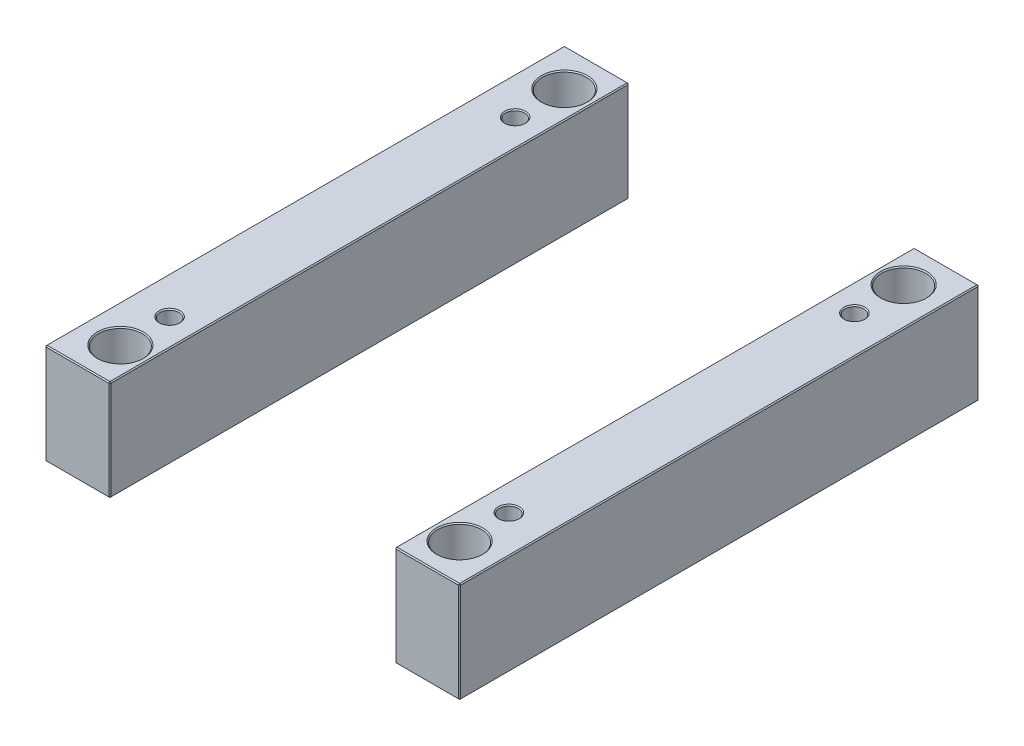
ISO-10303-21;
HEADER;
FILE_DESCRIPTION(('STEP AP214'),'2;1');
FILE_NAME('part.step','',(''),(''),'','','');
FILE_SCHEMA(('AUTOMOTIVE_DESIGN { 1 0 10303 214 1 1 1 1 }'));
ENDSEC;
DATA;
#1=APPLICATION_CONTEXT('core data for automotive mechanical design processes');
#2=APPLICATION_PROTOCOL_DEFINITION('international standard','automotive_design',2000,#1);
#3=PRODUCT_CONTEXT('',#1,'mechanical');
#4=PRODUCT('Part','Part','',(#3));
#5=PRODUCT_RELATED_PRODUCT_CATEGORY('part','',(#4));
#6=PRODUCT_DEFINITION_FORMATION('','',#4);
#7=PRODUCT_DEFINITION_CONTEXT('part definition',#1,'design');
#8=PRODUCT_DEFINITION('design','',#6,#7);
#9=PRODUCT_DEFINITION_SHAPE('','',#8);
#10=(LENGTH_UNIT() NAMED_UNIT(*) SI_UNIT(.MILLI.,.METRE.));
#11=(NAMED_UNIT(*) PLANE_ANGLE_UNIT() SI_UNIT($,.RADIAN.));
#12=(NAMED_UNIT(*) SI_UNIT($,.STERADIAN.) SOLID_ANGLE_UNIT());
#13=UNCERTAINTY_MEASURE_WITH_UNIT(LENGTH_MEASURE(1.E-05),#10,'distance_accuracy_value','');
#14=(GEOMETRIC_REPRESENTATION_CONTEXT(3) GLOBAL_UNCERTAINTY_ASSIGNED_CONTEXT((#13)) GLOBAL_UNIT_ASSIGNED_CONTEXT((#10,
#11,#12)) REPRESENTATION_CONTEXT('',''));
#15=CARTESIAN_POINT('',(0.,0.,0.));
#16=DIRECTION('',(0.,0.,1.));
#17=DIRECTION('',(1.,0.,0.));
#18=AXIS2_PLACEMENT_3D('',#15,#16,#17);
#19=CARTESIAN_POINT('',(-198.,96.,-248.));
#20=DIRECTION('',(0.,0.,1.));
#21=DIRECTION('',(1.,0.,0.));
#22=AXIS2_PLACEMENT_3D('',#19,#20,#21);
#23=PLANE('',#22);
#24=DIRECTION('',(-1.,0.,0.));
#25=VECTOR('',#24,1.);
#26=CARTESIAN_POINT('',(-198.,1.,-248.));
#27=LINE('',#26,#25);
#28=CARTESIAN_POINT('',(-137.,1.,-248.));
#29=VERTEX_POINT('',#28);
#30=CARTESIAN_POINT('',(-197.,1.,-248.));
#31=VERTEX_POINT('',#30);
#32=EDGE_CURVE('P0_E137',#29,#31,#27,.T.);
#33=ORIENTED_EDGE('',*,*,#32,.T.);
#34=DIRECTION('',(0.,1.,0.));
#35=VECTOR('',#34,1.);
#36=CARTESIAN_POINT('',(-197.,96.,-248.));
#37=LINE('',#36,#35);
#38=CARTESIAN_POINT('',(-197.,95.,-248.));
#39=VERTEX_POINT('',#38);
#40=EDGE_CURVE('P0_E265',#31,#39,#37,.T.);
#41=ORIENTED_EDGE('',*,*,#40,.T.);
#42=DIRECTION('',(1.,0.,0.));
#43=VECTOR('',#42,1.);
#44=CARTESIAN_POINT('',(-198.,95.,-248.));
#45=LINE('',#44,#43);
#46=CARTESIAN_POINT('',(-137.,95.,-248.));
#47=VERTEX_POINT('',#46);
#48=EDGE_CURVE('P0_E263',#39,#47,#45,.T.);
#49=ORIENTED_EDGE('',*,*,#48,.T.);
#50=DIRECTION('',(0.,-1.,0.));
#51=VECTOR('',#50,1.);
#52=CARTESIAN_POINT('',(-137.,96.,-248.));
#53=LINE('',#52,#51);
#54=EDGE_CURVE('P0_E260',#47,#29,#53,.T.);
#55=ORIENTED_EDGE('',*,*,#54,.T.);
#56=EDGE_LOOP('',(#33,#41,#49,#55));
#57=FACE_BOUND('',#56,.T.);
#58=ADVANCED_FACE('P0_F16',(#57),#23,.F.);
#59=CARTESIAN_POINT('',(-198.,96.,248.));
#60=DIRECTION('',(1.,0.,0.));
#61=DIRECTION('',(0.,0.,-1.));
#62=AXIS2_PLACEMENT_3D('',#59,#60,#61);
#63=PLANE('',#62);
#64=DIRECTION('',(0.,1.,0.));
#65=VECTOR('',#64,1.);
#66=CARTESIAN_POINT('',(-198.,96.,247.));
#67=LINE('',#66,#65);
#68=CARTESIAN_POINT('',(-198.,1.,247.));
#69=VERTEX_POINT('',#68);
#70=CARTESIAN_POINT('',(-198.,95.,247.));
#71=VERTEX_POINT('',#70);
#72=EDGE_CURVE('P0_E253',#69,#71,#67,.T.);
#73=ORIENTED_EDGE('',*,*,#72,.T.);
#74=DIRECTION('',(0.,0.,-1.));
#75=VECTOR('',#74,1.);
#76=CARTESIAN_POINT('',(-198.,95.,248.));
#77=LINE('',#76,#75);
#78=CARTESIAN_POINT('',(-198.,95.,-247.));
#79=VERTEX_POINT('',#78);
#80=EDGE_CURVE('P0_E258',#71,#79,#77,.T.);
#81=ORIENTED_EDGE('',*,*,#80,.T.);
#82=DIRECTION('',(0.,-1.,0.));
#83=VECTOR('',#82,1.);
#84=CARTESIAN_POINT('',(-198.,96.,-247.));
#85=LINE('',#84,#83);
#86=CARTESIAN_POINT('',(-198.,1.,-247.));
#87=VERTEX_POINT('',#86);
#88=EDGE_CURVE('P0_E255',#79,#87,#85,.T.);
#89=ORIENTED_EDGE('',*,*,#88,.T.);
#90=DIRECTION('',(0.,0.,1.));
#91=VECTOR('',#90,1.);
#92=CARTESIAN_POINT('',(-198.,1.,248.));
#93=LINE('',#92,#91);
#94=EDGE_CURVE('P0_E251',#87,#69,#93,.T.);
#95=ORIENTED_EDGE('',*,*,#94,.T.);
#96=EDGE_LOOP('',(#73,#81,#89,#95));
#97=FACE_BOUND('',#96,.T.);
#98=ADVANCED_FACE('P0_F333',(#97),#63,.F.);
#99=CARTESIAN_POINT('',(-198.,96.,248.));
#100=DIRECTION('',(0.,0.,-1.));
#101=DIRECTION('',(-1.,0.,0.));
#102=AXIS2_PLACEMENT_3D('',#99,#100,#101);
#103=PLANE('',#102);
#104=DIRECTION('',(-1.,0.,0.));
#105=VECTOR('',#104,1.);
#106=CARTESIAN_POINT('',(-198.,95.,248.));
#107=LINE('',#106,#105);
#108=CARTESIAN_POINT('',(-137.,95.,248.));
#109=VERTEX_POINT('',#108);
#110=CARTESIAN_POINT('',(-197.,95.,248.));
#111=VERTEX_POINT('',#110);
#112=EDGE_CURVE('P0_E272',#109,#111,#107,.T.);
#113=ORIENTED_EDGE('',*,*,#112,.T.);
#114=DIRECTION('',(0.,-1.,0.));
#115=VECTOR('',#114,1.);
#116=CARTESIAN_POINT('',(-197.,96.,248.));
#117=LINE('',#116,#115);
#118=CARTESIAN_POINT('',(-197.,1.,248.));
#119=VERTEX_POINT('',#118);
#120=EDGE_CURVE('P0_E274',#111,#119,#117,.T.);
#121=ORIENTED_EDGE('',*,*,#120,.T.);
#122=DIRECTION('',(1.,0.,0.));
#123=VECTOR('',#122,1.);
#124=CARTESIAN_POINT('',(-136.,1.,248.));
#125=LINE('',#124,#123);
#126=CARTESIAN_POINT('',(-137.,1.,248.));
#127=VERTEX_POINT('',#126);
#128=EDGE_CURVE('P0_E270',#119,#127,#125,.T.);
#129=ORIENTED_EDGE('',*,*,#128,.T.);
#130=DIRECTION('',(0.,1.,0.));
#131=VECTOR('',#130,1.);
#132=CARTESIAN_POINT('',(-137.,96.,248.));
#133=LINE('',#132,#131);
#134=EDGE_CURVE('P0_E268',#127,#109,#133,.T.);
#135=ORIENTED_EDGE('',*,*,#134,.T.);
#136=EDGE_LOOP('',(#113,#121,#129,#135));
#137=FACE_BOUND('',#136,.T.);
#138=ADVANCED_FACE('P0_F372',(#137),#103,.F.);
#139=CARTESIAN_POINT('',(-136.,96.,-248.));
#140=DIRECTION('',(-1.,0.,0.));
#141=DIRECTION('',(0.,0.,1.));
#142=AXIS2_PLACEMENT_3D('',#139,#140,#141);
#143=PLANE('',#142);
#144=DIRECTION('',(0.,0.,1.));
#145=VECTOR('',#144,1.);
#146=CARTESIAN_POINT('',(-136.,95.,-248.));
#147=LINE('',#146,#145);
#148=CARTESIAN_POINT('',(-136.,95.,-247.));
#149=VERTEX_POINT('',#148);
#150=CARTESIAN_POINT('',(-136.,95.,247.));
#151=VERTEX_POINT('',#150);
#152=EDGE_CURVE('P0_E31',#149,#151,#147,.T.);
#153=ORIENTED_EDGE('',*,*,#152,.T.);
#154=DIRECTION('',(0.,-1.,0.));
#155=VECTOR('',#154,1.);
#156=CARTESIAN_POINT('',(-136.,96.,247.));
#157=LINE('',#156,#155);
#158=CARTESIAN_POINT('',(-136.,1.,247.));
#159=VERTEX_POINT('',#158);
#160=EDGE_CURVE('P0_E190',#151,#159,#157,.T.);
#161=ORIENTED_EDGE('',*,*,#160,.T.);
#162=DIRECTION('',(0.,0.,-1.));
#163=VECTOR('',#162,1.);
#164=CARTESIAN_POINT('',(-136.,1.,-248.));
#165=LINE('',#164,#163);
#166=CARTESIAN_POINT('',(-136.,1.,-247.));
#167=VERTEX_POINT('',#166);
#168=EDGE_CURVE('P0_E286',#159,#167,#165,.T.);
#169=ORIENTED_EDGE('',*,*,#168,.T.);
#170=DIRECTION('',(0.,1.,0.));
#171=VECTOR('',#170,1.);
#172=CARTESIAN_POINT('',(-136.,96.,-247.));
#173=LINE('',#172,#171);
#174=EDGE_CURVE('P0_E36',#167,#149,#173,.T.);
#175=ORIENTED_EDGE('',*,*,#174,.T.);
#176=EDGE_LOOP('',(#153,#161,#169,#175));
#177=FACE_BOUND('',#176,.T.);
#178=ADVANCED_FACE('P0_F649',(#177),#143,.F.);
#179=CARTESIAN_POINT('',(0.,96.,0.));
#180=DIRECTION('',(0.,-1.,0.));
#181=DIRECTION('',(0.,0.,-1.));
#182=AXIS2_PLACEMENT_3D('',#179,#180,#181);
#183=PLANE('',#182);
#184=CARTESIAN_POINT('',(-162.,96.,-212.));
#185=DIRECTION('',(0.,-1.,0.));
#186=DIRECTION('',(0.,0.,-1.));
#187=AXIS2_PLACEMENT_3D('',#184,#185,#186);
#188=CIRCLE('',#187,22.);
#189=CARTESIAN_POINT('',(-162.,96.,-234.));
#190=VERTEX_POINT('',#189);
#191=EDGE_CURVE('P0_E214',#190,#190,#188,.T.);
#192=ORIENTED_EDGE('',*,*,#191,.T.);
#193=EDGE_LOOP('',(#192));
#194=FACE_BOUND('',#193,.T.);
#195=CARTESIAN_POINT('',(-162.,96.,212.));
#196=DIRECTION('',(0.,-1.,0.));
#197=DIRECTION('',(0.,0.,-1.));
#198=AXIS2_PLACEMENT_3D('',#195,#196,#197);
#199=CIRCLE('',#198,22.);
#200=CARTESIAN_POINT('',(-162.,96.,190.));
#201=VERTEX_POINT('',#200);
#202=EDGE_CURVE('P0_E211',#201,#201,#199,.T.);
#203=ORIENTED_EDGE('',*,*,#202,.T.);
#204=EDGE_LOOP('',(#203));
#205=FACE_BOUND('',#204,.T.);
#206=CARTESIAN_POINT('',(-162.,96.,165.));
#207=DIRECTION('',(0.,-1.,0.));
#208=DIRECTION('',(0.,0.,-1.));
#209=AXIS2_PLACEMENT_3D('',#206,#207,#208);
#210=CIRCLE('',#209,10.);
#211=CARTESIAN_POINT('',(-162.,96.,155.));
#212=VERTEX_POINT('',#211);
#213=EDGE_CURVE('P0_E193',#212,#212,#210,.T.);
#214=ORIENTED_EDGE('',*,*,#213,.T.);
#215=EDGE_LOOP('',(#214));
#216=FACE_BOUND('',#215,.T.);
#217=CARTESIAN_POINT('',(-162.,96.,-165.));
#218=DIRECTION('',(0.,-1.,0.));
#219=DIRECTION('',(0.,0.,-1.));
#220=AXIS2_PLACEMENT_3D('',#217,#218,#219);
#221=CIRCLE('',#220,10.);
#222=CARTESIAN_POINT('',(-162.,96.,-175.));
#223=VERTEX_POINT('',#222);
#224=EDGE_CURVE('P0_E189',#223,#223,#221,.T.);
#225=ORIENTED_EDGE('',*,*,#224,.T.);
#226=EDGE_LOOP('',(#225));
#227=FACE_BOUND('',#226,.T.);
#228=DIRECTION('',(0.,0.,1.));
#229=VECTOR('',#228,1.);
#230=CARTESIAN_POINT('',(-197.,96.,0.));
#231=LINE('',#230,#229);
#232=CARTESIAN_POINT('',(-197.,96.,-247.));
#233=VERTEX_POINT('',#232);
#234=CARTESIAN_POINT('',(-197.,96.,247.));
#235=VERTEX_POINT('',#234);
#236=EDGE_CURVE('P0_E281',#233,#235,#231,.T.);
#237=ORIENTED_EDGE('',*,*,#236,.T.);
#238=DIRECTION('',(1.,0.,0.));
#239=VECTOR('',#238,1.);
#240=CARTESIAN_POINT('',(0.,96.,247.));
#241=LINE('',#240,#239);
#242=CARTESIAN_POINT('',(-137.,96.,247.));
#243=VERTEX_POINT('',#242);
#244=EDGE_CURVE('P0_E283',#235,#243,#241,.T.);
#245=ORIENTED_EDGE('',*,*,#244,.T.);
#246=DIRECTION('',(0.,0.,-1.));
#247=VECTOR('',#246,1.);
#248=CARTESIAN_POINT('',(-137.,96.,0.));
#249=LINE('',#248,#247);
#250=CARTESIAN_POINT('',(-137.,96.,-247.));
#251=VERTEX_POINT('',#250);
#252=EDGE_CURVE('P0_E277',#243,#251,#249,.T.);
#253=ORIENTED_EDGE('',*,*,#252,.T.);
#254=DIRECTION('',(-1.,0.,0.));
#255=VECTOR('',#254,1.);
#256=CARTESIAN_POINT('',(0.,96.,-247.));
#257=LINE('',#256,#255);
#258=EDGE_CURVE('P0_E279',#251,#233,#257,.T.);
#259=ORIENTED_EDGE('',*,*,#258,.T.);
#260=EDGE_LOOP('',(#237,#245,#253,#259));
#261=FACE_BOUND('',#260,.T.);
#262=ADVANCED_FACE('P0_F229',(#194,#205,#216,#227,#261),#183,.F.);
#263=CARTESIAN_POINT('',(0.,0.,0.));
#264=DIRECTION('',(0.,-1.,0.));
#265=DIRECTION('',(0.,0.,-1.));
#266=AXIS2_PLACEMENT_3D('',#263,#264,#265);
#267=PLANE('',#266);
#268=CARTESIAN_POINT('',(-162.,0.,-212.));
#269=DIRECTION('',(0.,-1.,0.));
#270=DIRECTION('',(0.,0.,-1.));
#271=AXIS2_PLACEMENT_3D('',#268,#269,#270);
#272=CIRCLE('',#271,22.);
#273=CARTESIAN_POINT('',(-162.,0.,-234.));
#274=VERTEX_POINT('',#273);
#275=EDGE_CURVE('P0_E202',#274,#274,#272,.F.);
#276=ORIENTED_EDGE('',*,*,#275,.T.);
#277=EDGE_LOOP('',(#276));
#278=FACE_BOUND('',#277,.T.);
#279=CARTESIAN_POINT('',(-162.,0.,212.));
#280=DIRECTION('',(0.,-1.,0.));
#281=DIRECTION('',(0.,0.,-1.));
#282=AXIS2_PLACEMENT_3D('',#279,#280,#281);
#283=CIRCLE('',#282,22.);
#284=CARTESIAN_POINT('',(-162.,0.,190.));
#285=VERTEX_POINT('',#284);
#286=EDGE_CURVE('P0_E199',#285,#285,#283,.F.);
#287=ORIENTED_EDGE('',*,*,#286,.T.);
#288=EDGE_LOOP('',(#287));
#289=FACE_BOUND('',#288,.T.);
#290=CARTESIAN_POINT('',(-162.,0.,-165.));
#291=DIRECTION('',(0.,-1.,0.));
#292=DIRECTION('',(0.,0.,-1.));
#293=AXIS2_PLACEMENT_3D('',#290,#291,#292);
#294=CIRCLE('',#293,10.);
#295=CARTESIAN_POINT('',(-162.,0.,-175.));
#296=VERTEX_POINT('',#295);
#297=EDGE_CURVE('P0_E235',#296,#296,#294,.F.);
#298=ORIENTED_EDGE('',*,*,#297,.T.);
#299=EDGE_LOOP('',(#298));
#300=FACE_BOUND('',#299,.T.);
#301=CARTESIAN_POINT('',(-162.,0.,165.));
#302=DIRECTION('',(0.,-1.,0.));
#303=DIRECTION('',(0.,0.,-1.));
#304=AXIS2_PLACEMENT_3D('',#301,#302,#303);
#305=CIRCLE('',#304,10.);
#306=CARTESIAN_POINT('',(-162.,0.,155.));
#307=VERTEX_POINT('',#306);
#308=EDGE_CURVE('P0_E238',#307,#307,#305,.F.);
#309=ORIENTED_EDGE('',*,*,#308,.T.);
#310=EDGE_LOOP('',(#309));
#311=FACE_BOUND('',#310,.T.);
#312=DIRECTION('',(-1.,0.,0.));
#313=VECTOR('',#312,1.);
#314=CARTESIAN_POINT('',(-198.,0.,247.));
#315=LINE('',#314,#313);
#316=CARTESIAN_POINT('',(-137.,0.,247.));
#317=VERTEX_POINT('',#316);
#318=CARTESIAN_POINT('',(-197.,0.,247.));
#319=VERTEX_POINT('',#318);
#320=EDGE_CURVE('P0_E114',#317,#319,#315,.T.);
#321=ORIENTED_EDGE('',*,*,#320,.T.);
#322=DIRECTION('',(0.,0.,-1.));
#323=VECTOR('',#322,1.);
#324=CARTESIAN_POINT('',(-197.,0.,-248.));
#325=LINE('',#324,#323);
#326=CARTESIAN_POINT('',(-197.,0.,-247.));
#327=VERTEX_POINT('',#326);
#328=EDGE_CURVE('P0_E110',#319,#327,#325,.T.);
#329=ORIENTED_EDGE('',*,*,#328,.T.);
#330=DIRECTION('',(1.,0.,0.));
#331=VECTOR('',#330,1.);
#332=CARTESIAN_POINT('',(-136.,0.,-247.));
#333=LINE('',#332,#331);
#334=CARTESIAN_POINT('',(-137.,0.,-247.));
#335=VERTEX_POINT('',#334);
#336=EDGE_CURVE('P0_E104',#327,#335,#333,.T.);
#337=ORIENTED_EDGE('',*,*,#336,.T.);
#338=DIRECTION('',(0.,0.,1.));
#339=VECTOR('',#338,1.);
#340=CARTESIAN_POINT('',(-137.,0.,248.));
#341=LINE('',#340,#339);
#342=EDGE_CURVE('P0_E107',#335,#317,#341,.T.);
#343=ORIENTED_EDGE('',*,*,#342,.T.);
#344=EDGE_LOOP('',(#321,#329,#337,#343));
#345=FACE_BOUND('',#344,.T.);
#346=ADVANCED_FACE('P0_F106',(#278,#289,#300,#311,#345),#267,.T.);
#347=CARTESIAN_POINT('',(-162.,0.,-165.));
#348=DIRECTION('',(0.,1.,0.));
#349=DIRECTION('',(0.,0.,1.));
#350=AXIS2_PLACEMENT_3D('',#347,#348,#349);
#351=CYLINDRICAL_SURFACE('',#350,9.);
#352=CARTESIAN_POINT('',(-162.,95.,-165.));
#353=DIRECTION('',(0.,-1.,0.));
#354=DIRECTION('',(0.,0.,-1.));
#355=AXIS2_PLACEMENT_3D('',#352,#353,#354);
#356=CIRCLE('',#355,9.);
#357=CARTESIAN_POINT('',(-162.,95.,-174.));
#358=VERTEX_POINT('',#357);
#359=EDGE_CURVE('P0_E196',#358,#358,#356,.F.);
#360=ORIENTED_EDGE('',*,*,#359,.T.);
#361=EDGE_LOOP('',(#360));
#362=FACE_BOUND('',#361,.T.);
#363=CARTESIAN_POINT('',(-162.,0.999999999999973,-165.));
#364=DIRECTION('',(0.,-1.,0.));
#365=DIRECTION('',(0.,0.,-1.));
#366=AXIS2_PLACEMENT_3D('',#363,#364,#365);
#367=CIRCLE('',#366,9.);
#368=CARTESIAN_POINT('',(-162.,0.999999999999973,-174.));
#369=VERTEX_POINT('',#368);
#370=EDGE_CURVE('P0_E241',#369,#369,#367,.T.);
#371=ORIENTED_EDGE('',*,*,#370,.T.);
#372=EDGE_LOOP('',(#371));
#373=FACE_BOUND('',#372,.T.);
#374=ADVANCED_FACE('P0_F228',(#362,#373),#351,.F.);
#375=CARTESIAN_POINT('',(-162.,0.,165.));
#376=DIRECTION('',(0.,1.,0.));
#377=DIRECTION('',(0.,0.,1.));
#378=AXIS2_PLACEMENT_3D('',#375,#376,#377);
#379=CYLINDRICAL_SURFACE('',#378,9.);
#380=CARTESIAN_POINT('',(-162.,95.,165.));
#381=DIRECTION('',(0.,-1.,0.));
#382=DIRECTION('',(0.,0.,-1.));
#383=AXIS2_PLACEMENT_3D('',#380,#381,#382);
#384=CIRCLE('',#383,9.);
#385=CARTESIAN_POINT('',(-162.,95.,156.));
#386=VERTEX_POINT('',#385);
#387=EDGE_CURVE('P0_E186',#386,#386,#384,.F.);
#388=ORIENTED_EDGE('',*,*,#387,.T.);
#389=EDGE_LOOP('',(#388));
#390=FACE_BOUND('',#389,.T.);
#391=CARTESIAN_POINT('',(-162.,0.999999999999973,165.));
#392=DIRECTION('',(0.,-1.,0.));
#393=DIRECTION('',(0.,0.,-1.));
#394=AXIS2_PLACEMENT_3D('',#391,#392,#393);
#395=CIRCLE('',#394,9.);
#396=CARTESIAN_POINT('',(-162.,0.999999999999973,156.));
#397=VERTEX_POINT('',#396);
#398=EDGE_CURVE('P0_E248',#397,#397,#395,.T.);
#399=ORIENTED_EDGE('',*,*,#398,.T.);
#400=EDGE_LOOP('',(#399));
#401=FACE_BOUND('',#400,.T.);
#402=ADVANCED_FACE('P0_F380',(#390,#401),#379,.F.);
#403=CARTESIAN_POINT('',(-162.,0.,-165.));
#404=DIRECTION('',(0.,-1.,0.));
#405=DIRECTION('',(0.,0.,-1.));
#406=AXIS2_PLACEMENT_3D('',#403,#404,#405);
#407=CONICAL_SURFACE('',#406,10.,0.78539816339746);
#408=ORIENTED_EDGE('',*,*,#370,.F.);
#409=EDGE_LOOP('',(#408));
#410=FACE_BOUND('',#409,.T.);
#411=ORIENTED_EDGE('',*,*,#297,.F.);
#412=EDGE_LOOP('',(#411));
#413=FACE_BOUND('',#412,.T.);
#414=ADVANCED_FACE('P0_F376',(#410,#413),#407,.F.);
#415=CARTESIAN_POINT('',(-162.,0.,165.));
#416=DIRECTION('',(0.,-1.,0.));
#417=DIRECTION('',(0.,0.,-1.));
#418=AXIS2_PLACEMENT_3D('',#415,#416,#417);
#419=CONICAL_SURFACE('',#418,10.,0.78539816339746);
#420=ORIENTED_EDGE('',*,*,#398,.F.);
#421=EDGE_LOOP('',(#420));
#422=FACE_BOUND('',#421,.T.);
#423=ORIENTED_EDGE('',*,*,#308,.F.);
#424=EDGE_LOOP('',(#423));
#425=FACE_BOUND('',#424,.T.);
#426=ADVANCED_FACE('P0_F379',(#422,#425),#419,.F.);
#427=CARTESIAN_POINT('',(-136.,96.,247.));
#428=DIRECTION('',(-0.707106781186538,0.,-0.707106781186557));
#429=DIRECTION('',(0.,-1.,0.));
#430=AXIS2_PLACEMENT_3D('',#427,#428,#429);
#431=PLANE('',#430);
#432=DIRECTION('',(-0.707106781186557,0.,0.707106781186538));
#433=VECTOR('',#432,1.);
#434=CARTESIAN_POINT('',(-136.5,95.,247.5));
#435=LINE('',#434,#433);
#436=EDGE_CURVE('P0_E125',#109,#151,#435,.F.);
#437=ORIENTED_EDGE('',*,*,#436,.F.);
#438=ORIENTED_EDGE('',*,*,#134,.F.);
#439=DIRECTION('',(0.707106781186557,0.,-0.707106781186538));
#440=VECTOR('',#439,1.);
#441=CARTESIAN_POINT('',(-137.,1.,248.));
#442=LINE('',#441,#440);
#443=EDGE_CURVE('P0_E181',#159,#127,#442,.F.);
#444=ORIENTED_EDGE('',*,*,#443,.F.);
#445=ORIENTED_EDGE('',*,*,#160,.F.);
#446=EDGE_LOOP('',(#437,#438,#444,#445));
#447=FACE_BOUND('',#446,.T.);
#448=ADVANCED_FACE('P0_F384',(#447),#431,.F.);
#449=CARTESIAN_POINT('',(-137.,96.,247.));
#450=DIRECTION('',(0.577350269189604,0.57735026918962,0.577350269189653));
#451=DIRECTION('',(0.,-0.707106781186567,0.707106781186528));
#452=AXIS2_PLACEMENT_3D('',#449,#450,#451);
#453=PLANE('',#452);
#454=DIRECTION('',(0.,0.707106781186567,-0.707106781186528));
#455=VECTOR('',#454,1.);
#456=CARTESIAN_POINT('',(-137.,96.,247.));
#457=LINE('',#456,#455);
#458=EDGE_CURVE('P0_E175',#109,#243,#457,.T.);
#459=ORIENTED_EDGE('',*,*,#458,.F.);
#460=ORIENTED_EDGE('',*,*,#436,.T.);
#461=DIRECTION('',(0.707106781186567,-0.707106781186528,0.));
#462=VECTOR('',#461,1.);
#463=CARTESIAN_POINT('',(-137.,96.,247.));
#464=LINE('',#463,#462);
#465=EDGE_CURVE('P0_E178',#243,#151,#464,.T.);
#466=ORIENTED_EDGE('',*,*,#465,.F.);
#467=EDGE_LOOP('',(#459,#460,#466));
#468=FACE_BOUND('',#467,.T.);
#469=ADVANCED_FACE('P0_F588',(#468),#453,.T.);
#470=CARTESIAN_POINT('',(-137.,1.,248.));
#471=DIRECTION('',(0.577350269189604,-0.577350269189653,0.57735026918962));
#472=DIRECTION('',(0.,-0.707106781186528,-0.707106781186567));
#473=AXIS2_PLACEMENT_3D('',#470,#471,#472);
#474=PLANE('',#473);
#475=DIRECTION('',(0.707106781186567,0.707106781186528,0.));
#476=VECTOR('',#475,1.);
#477=CARTESIAN_POINT('',(-136.5,0.499999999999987,247.));
#478=LINE('',#477,#476);
#479=EDGE_CURVE('P0_E123',#159,#317,#478,.F.);
#480=ORIENTED_EDGE('',*,*,#479,.F.);
#481=ORIENTED_EDGE('',*,*,#443,.T.);
#482=DIRECTION('',(0.,-0.707106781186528,-0.707106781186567));
#483=VECTOR('',#482,1.);
#484=CARTESIAN_POINT('',(-137.,1.,248.));
#485=LINE('',#484,#483);
#486=EDGE_CURVE('P0_E172',#317,#127,#485,.F.);
#487=ORIENTED_EDGE('',*,*,#486,.F.);
#488=EDGE_LOOP('',(#480,#481,#487));
#489=FACE_BOUND('',#488,.T.);
#490=ADVANCED_FACE('P0_F597',(#489),#474,.T.);
#491=CARTESIAN_POINT('',(-137.,96.,0.));
#492=DIRECTION('',(-0.707106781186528,-0.707106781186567,0.));
#493=DIRECTION('',(0.,0.,-1.));
#494=AXIS2_PLACEMENT_3D('',#491,#492,#493);
#495=PLANE('',#494);
#496=ORIENTED_EDGE('',*,*,#465,.T.);
#497=ORIENTED_EDGE('',*,*,#152,.F.);
#498=DIRECTION('',(-0.707106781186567,0.707106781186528,0.));
#499=VECTOR('',#498,1.);
#500=CARTESIAN_POINT('',(-136.5,95.5,-247.));
#501=LINE('',#500,#499);
#502=EDGE_CURVE('P0_E165',#251,#149,#501,.F.);
#503=ORIENTED_EDGE('',*,*,#502,.F.);
#504=ORIENTED_EDGE('',*,*,#252,.F.);
#505=EDGE_LOOP('',(#496,#497,#503,#504));
#506=FACE_BOUND('',#505,.T.);
#507=ADVANCED_FACE('P0_F349',(#506),#495,.F.);
#508=CARTESIAN_POINT('',(0.,96.,247.));
#509=DIRECTION('',(0.,-0.707106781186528,-0.707106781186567));
#510=DIRECTION('',(1.,0.,0.));
#511=AXIS2_PLACEMENT_3D('',#508,#509,#510);
#512=PLANE('',#511);
#513=ORIENTED_EDGE('',*,*,#458,.T.);
#514=ORIENTED_EDGE('',*,*,#244,.F.);
#515=DIRECTION('',(0.,-0.707106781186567,0.707106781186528));
#516=VECTOR('',#515,1.);
#517=CARTESIAN_POINT('',(-197.,95.5,247.5));
#518=LINE('',#517,#516);
#519=EDGE_CURVE('P0_E162',#111,#235,#518,.F.);
#520=ORIENTED_EDGE('',*,*,#519,.F.);
#521=ORIENTED_EDGE('',*,*,#112,.F.);
#522=EDGE_LOOP('',(#513,#514,#520,#521));
#523=FACE_BOUND('',#522,.T.);
#524=ADVANCED_FACE('P0_F344',(#523),#512,.F.);
#525=CARTESIAN_POINT('',(-197.,96.,248.));
#526=DIRECTION('',(0.707106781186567,0.,-0.707106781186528));
#527=DIRECTION('',(0.,-1.,0.));
#528=AXIS2_PLACEMENT_3D('',#525,#526,#527);
#529=PLANE('',#528);
#530=DIRECTION('',(0.707106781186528,0.,0.707106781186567));
#531=VECTOR('',#530,1.);
#532=CARTESIAN_POINT('',(-197.,1.,248.));
#533=LINE('',#532,#531);
#534=EDGE_CURVE('P0_E156',#119,#69,#533,.F.);
#535=ORIENTED_EDGE('',*,*,#534,.F.);
#536=ORIENTED_EDGE('',*,*,#120,.F.);
#537=DIRECTION('',(-0.707106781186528,0.,-0.707106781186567));
#538=VECTOR('',#537,1.);
#539=CARTESIAN_POINT('',(-198.,95.,247.));
#540=LINE('',#539,#538);
#541=EDGE_CURVE('P0_E159',#71,#111,#540,.F.);
#542=ORIENTED_EDGE('',*,*,#541,.F.);
#543=ORIENTED_EDGE('',*,*,#72,.F.);
#544=EDGE_LOOP('',(#535,#536,#542,#543));
#545=FACE_BOUND('',#544,.T.);
#546=ADVANCED_FACE('P0_F338',(#545),#529,.F.);
#547=CARTESIAN_POINT('',(-198.,1.,248.));
#548=DIRECTION('',(0.,-0.707106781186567,0.707106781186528));
#549=DIRECTION('',(-1.,0.,0.));
#550=AXIS2_PLACEMENT_3D('',#547,#548,#549);
#551=PLANE('',#550);
#552=ORIENTED_EDGE('',*,*,#486,.T.);
#553=ORIENTED_EDGE('',*,*,#128,.F.);
#554=DIRECTION('',(0.,0.707106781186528,0.707106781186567));
#555=VECTOR('',#554,1.);
#556=CARTESIAN_POINT('',(-197.,1.,248.));
#557=LINE('',#556,#555);
#558=EDGE_CURVE('P0_E134',#319,#119,#557,.T.);
#559=ORIENTED_EDGE('',*,*,#558,.F.);
#560=ORIENTED_EDGE('',*,*,#320,.F.);
#561=EDGE_LOOP('',(#552,#553,#559,#560));
#562=FACE_BOUND('',#561,.T.);
#563=ADVANCED_FACE('P0_F364',(#562),#551,.T.);
#564=CARTESIAN_POINT('',(-136.,1.,-248.));
#565=DIRECTION('',(0.707106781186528,-0.707106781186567,0.));
#566=DIRECTION('',(0.,0.,1.));
#567=AXIS2_PLACEMENT_3D('',#564,#565,#566);
#568=PLANE('',#567);
#569=ORIENTED_EDGE('',*,*,#479,.T.);
#570=ORIENTED_EDGE('',*,*,#342,.F.);
#571=DIRECTION('',(-0.707106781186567,-0.707106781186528,0.));
#572=VECTOR('',#571,1.);
#573=CARTESIAN_POINT('',(-137.,0.,-247.));
#574=LINE('',#573,#572);
#575=EDGE_CURVE('P0_E120',#167,#335,#574,.T.);
#576=ORIENTED_EDGE('',*,*,#575,.F.);
#577=ORIENTED_EDGE('',*,*,#168,.F.);
#578=EDGE_LOOP('',(#569,#570,#576,#577));
#579=FACE_BOUND('',#578,.T.);
#580=ADVANCED_FACE('P0_F119',(#579),#568,.T.);
#581=CARTESIAN_POINT('',(-137.,96.,-248.));
#582=DIRECTION('',(-0.707106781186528,0.,0.707106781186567));
#583=DIRECTION('',(0.,-1.,0.));
#584=AXIS2_PLACEMENT_3D('',#581,#582,#583);
#585=PLANE('',#584);
#586=DIRECTION('',(0.707106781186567,0.,0.707106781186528));
#587=VECTOR('',#586,1.);
#588=CARTESIAN_POINT('',(-137.,95.,-248.));
#589=LINE('',#588,#587);
#590=EDGE_CURVE('P0_E168',#149,#47,#589,.F.);
#591=ORIENTED_EDGE('',*,*,#590,.F.);
#592=ORIENTED_EDGE('',*,*,#174,.F.);
#593=DIRECTION('',(-0.707106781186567,0.,-0.707106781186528));
#594=VECTOR('',#593,1.);
#595=CARTESIAN_POINT('',(-136.5,1.,-247.5));
#596=LINE('',#595,#594);
#597=EDGE_CURVE('P0_E133',#29,#167,#596,.F.);
#598=ORIENTED_EDGE('',*,*,#597,.F.);
#599=ORIENTED_EDGE('',*,*,#54,.F.);
#600=EDGE_LOOP('',(#591,#592,#598,#599));
#601=FACE_BOUND('',#600,.T.);
#602=ADVANCED_FACE('P0_F354',(#601),#585,.F.);
#603=CARTESIAN_POINT('',(-137.,95.,-248.));
#604=DIRECTION('',(0.577350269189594,0.577350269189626,-0.577350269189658));
#605=DIRECTION('',(0.,0.707106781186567,0.707106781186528));
#606=AXIS2_PLACEMENT_3D('',#603,#604,#605);
#607=PLANE('',#606);
#608=ORIENTED_EDGE('',*,*,#502,.T.);
#609=ORIENTED_EDGE('',*,*,#590,.T.);
#610=DIRECTION('',(0.,-0.707106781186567,-0.707106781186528));
#611=VECTOR('',#610,1.);
#612=CARTESIAN_POINT('',(-137.,95.,-248.));
#613=LINE('',#612,#611);
#614=EDGE_CURVE('P0_E151',#251,#47,#613,.T.);
#615=ORIENTED_EDGE('',*,*,#614,.F.);
#616=EDGE_LOOP('',(#608,#609,#615));
#617=FACE_BOUND('',#616,.T.);
#618=ADVANCED_FACE('P0_F352',(#617),#607,.T.);
#619=CARTESIAN_POINT('',(-198.,95.,247.));
#620=DIRECTION('',(-0.577350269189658,0.577350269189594,0.577350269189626));
#621=DIRECTION('',(0.707106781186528,0.,0.707106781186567));
#622=AXIS2_PLACEMENT_3D('',#619,#620,#621);
#623=PLANE('',#622);
#624=ORIENTED_EDGE('',*,*,#541,.T.);
#625=ORIENTED_EDGE('',*,*,#519,.T.);
#626=DIRECTION('',(0.707106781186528,0.707106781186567,0.));
#627=VECTOR('',#626,1.);
#628=CARTESIAN_POINT('',(-198.,95.,247.));
#629=LINE('',#628,#627);
#630=EDGE_CURVE('P0_E142',#71,#235,#629,.T.);
#631=ORIENTED_EDGE('',*,*,#630,.F.);
#632=EDGE_LOOP('',(#624,#625,#631));
#633=FACE_BOUND('',#632,.T.);
#634=ADVANCED_FACE('P0_F341',(#633),#623,.T.);
#635=CARTESIAN_POINT('',(-197.,1.,248.));
#636=DIRECTION('',(-0.577350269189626,-0.577350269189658,0.577350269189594));
#637=DIRECTION('',(0.707106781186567,-0.707106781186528,0.));
#638=AXIS2_PLACEMENT_3D('',#635,#636,#637);
#639=PLANE('',#638);
#640=ORIENTED_EDGE('',*,*,#558,.T.);
#641=ORIENTED_EDGE('',*,*,#534,.T.);
#642=DIRECTION('',(0.707106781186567,-0.707106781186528,0.));
#643=VECTOR('',#642,1.);
#644=CARTESIAN_POINT('',(-197.5,0.5,247.));
#645=LINE('',#644,#643);
#646=EDGE_CURVE('P0_E138',#319,#69,#645,.F.);
#647=ORIENTED_EDGE('',*,*,#646,.F.);
#648=EDGE_LOOP('',(#640,#641,#647));
#649=FACE_BOUND('',#648,.T.);
#650=ADVANCED_FACE('P0_F403',(#649),#639,.T.);
#651=CARTESIAN_POINT('',(-137.,0.,-247.));
#652=DIRECTION('',(0.577350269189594,-0.577350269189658,-0.577350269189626));
#653=DIRECTION('',(0.,0.707106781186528,-0.707106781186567));
#654=AXIS2_PLACEMENT_3D('',#651,#652,#653);
#655=PLANE('',#654);
#656=ORIENTED_EDGE('',*,*,#597,.T.);
#657=ORIENTED_EDGE('',*,*,#575,.T.);
#658=DIRECTION('',(0.,0.707106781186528,-0.707106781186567));
#659=VECTOR('',#658,1.);
#660=CARTESIAN_POINT('',(-137.,0.,-247.));
#661=LINE('',#660,#659);
#662=EDGE_CURVE('P0_E130',#29,#335,#661,.F.);
#663=ORIENTED_EDGE('',*,*,#662,.F.);
#664=EDGE_LOOP('',(#656,#657,#663));
#665=FACE_BOUND('',#664,.T.);
#666=ADVANCED_FACE('P0_F129',(#665),#655,.T.);
#667=CARTESIAN_POINT('',(0.,96.,-247.));
#668=DIRECTION('',(0.,-0.707106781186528,0.707106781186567));
#669=DIRECTION('',(-1.,0.,0.));
#670=AXIS2_PLACEMENT_3D('',#667,#668,#669);
#671=PLANE('',#670);
#672=ORIENTED_EDGE('',*,*,#614,.T.);
#673=ORIENTED_EDGE('',*,*,#48,.F.);
#674=DIRECTION('',(0.,0.707106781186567,0.707106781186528));
#675=VECTOR('',#674,1.);
#676=CARTESIAN_POINT('',(-197.,95.,-248.));
#677=LINE('',#676,#675);
#678=EDGE_CURVE('P0_E139',#233,#39,#677,.F.);
#679=ORIENTED_EDGE('',*,*,#678,.F.);
#680=ORIENTED_EDGE('',*,*,#258,.F.);
#681=EDGE_LOOP('',(#672,#673,#679,#680));
#682=FACE_BOUND('',#681,.T.);
#683=ADVANCED_FACE('P0_F316',(#682),#671,.F.);
#684=CARTESIAN_POINT('',(-197.,96.,0.));
#685=DIRECTION('',(0.707106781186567,-0.707106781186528,0.));
#686=DIRECTION('',(0.,0.,1.));
#687=AXIS2_PLACEMENT_3D('',#684,#685,#686);
#688=PLANE('',#687);
#689=ORIENTED_EDGE('',*,*,#630,.T.);
#690=ORIENTED_EDGE('',*,*,#236,.F.);
#691=DIRECTION('',(-0.707106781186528,-0.707106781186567,0.));
#692=VECTOR('',#691,1.);
#693=CARTESIAN_POINT('',(-197.5,95.5,-247.));
#694=LINE('',#693,#692);
#695=EDGE_CURVE('P0_E145',#79,#233,#694,.F.);
#696=ORIENTED_EDGE('',*,*,#695,.F.);
#697=ORIENTED_EDGE('',*,*,#80,.F.);
#698=EDGE_LOOP('',(#689,#690,#696,#697));
#699=FACE_BOUND('',#698,.T.);
#700=ADVANCED_FACE('P0_F310',(#699),#688,.F.);
#701=CARTESIAN_POINT('',(-198.,1.,248.));
#702=DIRECTION('',(-0.707106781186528,-0.707106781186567,0.));
#703=DIRECTION('',(0.,0.,-1.));
#704=AXIS2_PLACEMENT_3D('',#701,#702,#703);
#705=PLANE('',#704);
#706=ORIENTED_EDGE('',*,*,#646,.T.);
#707=ORIENTED_EDGE('',*,*,#94,.F.);
#708=DIRECTION('',(-0.707106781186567,0.707106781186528,0.));
#709=VECTOR('',#708,1.);
#710=CARTESIAN_POINT('',(-198.,1.,-247.));
#711=LINE('',#710,#709);
#712=EDGE_CURVE('P0_E297',#327,#87,#711,.T.);
#713=ORIENTED_EDGE('',*,*,#712,.F.);
#714=ORIENTED_EDGE('',*,*,#328,.F.);
#715=EDGE_LOOP('',(#706,#707,#713,#714));
#716=FACE_BOUND('',#715,.T.);
#717=ADVANCED_FACE('P0_F329',(#716),#705,.T.);
#718=CARTESIAN_POINT('',(-198.,1.,-248.));
#719=DIRECTION('',(0.,-0.707106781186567,-0.707106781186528));
#720=DIRECTION('',(1.,0.,0.));
#721=AXIS2_PLACEMENT_3D('',#718,#719,#720);
#722=PLANE('',#721);
#723=ORIENTED_EDGE('',*,*,#662,.T.);
#724=ORIENTED_EDGE('',*,*,#336,.F.);
#725=DIRECTION('',(0.,-0.707106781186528,0.707106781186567));
#726=VECTOR('',#725,1.);
#727=CARTESIAN_POINT('',(-197.,0.499999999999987,-247.5));
#728=LINE('',#727,#726);
#729=EDGE_CURVE('P0_E295',#31,#327,#728,.T.);
#730=ORIENTED_EDGE('',*,*,#729,.F.);
#731=ORIENTED_EDGE('',*,*,#32,.F.);
#732=EDGE_LOOP('',(#723,#724,#730,#731));
#733=FACE_BOUND('',#732,.T.);
#734=ADVANCED_FACE('P0_F136',(#733),#722,.T.);
#735=CARTESIAN_POINT('',(-197.,95.,-248.));
#736=DIRECTION('',(-0.577350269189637,0.577350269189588,-0.577350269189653));
#737=DIRECTION('',(-0.707106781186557,0.,0.707106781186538));
#738=AXIS2_PLACEMENT_3D('',#735,#736,#737);
#739=PLANE('',#738);
#740=ORIENTED_EDGE('',*,*,#695,.T.);
#741=ORIENTED_EDGE('',*,*,#678,.T.);
#742=DIRECTION('',(0.707106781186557,0.,-0.707106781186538));
#743=VECTOR('',#742,1.);
#744=CARTESIAN_POINT('',(-197.,95.,-248.));
#745=LINE('',#744,#743);
#746=EDGE_CURVE('P0_E293',#79,#39,#745,.T.);
#747=ORIENTED_EDGE('',*,*,#746,.F.);
#748=EDGE_LOOP('',(#740,#741,#747));
#749=FACE_BOUND('',#748,.T.);
#750=ADVANCED_FACE('P0_F303',(#749),#739,.T.);
#751=CARTESIAN_POINT('',(-198.,1.,-247.));
#752=DIRECTION('',(-0.577350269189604,-0.577350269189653,-0.57735026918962));
#753=DIRECTION('',(0.,0.707106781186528,-0.707106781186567));
#754=AXIS2_PLACEMENT_3D('',#751,#752,#753);
#755=PLANE('',#754);
#756=ORIENTED_EDGE('',*,*,#729,.T.);
#757=ORIENTED_EDGE('',*,*,#712,.T.);
#758=DIRECTION('',(-0.707106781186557,0.,0.707106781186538));
#759=VECTOR('',#758,1.);
#760=CARTESIAN_POINT('',(-198.,1.,-247.));
#761=LINE('',#760,#759);
#762=EDGE_CURVE('P0_E291',#31,#87,#761,.T.);
#763=ORIENTED_EDGE('',*,*,#762,.F.);
#764=EDGE_LOOP('',(#756,#757,#763));
#765=FACE_BOUND('',#764,.T.);
#766=ADVANCED_FACE('P0_F325',(#765),#755,.T.);
#767=CARTESIAN_POINT('',(-198.,96.,-247.));
#768=DIRECTION('',(0.707106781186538,0.,0.707106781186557));
#769=DIRECTION('',(0.,-1.,0.));
#770=AXIS2_PLACEMENT_3D('',#767,#768,#769);
#771=PLANE('',#770);
#772=ORIENTED_EDGE('',*,*,#746,.T.);
#773=ORIENTED_EDGE('',*,*,#40,.F.);
#774=ORIENTED_EDGE('',*,*,#762,.T.);
#775=ORIENTED_EDGE('',*,*,#88,.F.);
#776=EDGE_LOOP('',(#772,#773,#774,#775));
#777=FACE_BOUND('',#776,.T.);
#778=ADVANCED_FACE('P0_F323',(#777),#771,.F.);
#779=CARTESIAN_POINT('',(-162.,95.,165.));
#780=DIRECTION('',(0.,1.,0.));
#781=DIRECTION('',(0.,0.,1.));
#782=AXIS2_PLACEMENT_3D('',#779,#780,#781);
#783=CONICAL_SURFACE('',#782,9.,0.785398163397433);
#784=ORIENTED_EDGE('',*,*,#213,.F.);
#785=EDGE_LOOP('',(#784));
#786=FACE_BOUND('',#785,.T.);
#787=ORIENTED_EDGE('',*,*,#387,.F.);
#788=EDGE_LOOP('',(#787));
#789=FACE_BOUND('',#788,.T.);
#790=ADVANCED_FACE('P0_F388',(#786,#789),#783,.F.);
#791=CARTESIAN_POINT('',(-162.,95.,-165.));
#792=DIRECTION('',(0.,1.,0.));
#793=DIRECTION('',(0.,0.,1.));
#794=AXIS2_PLACEMENT_3D('',#791,#792,#793);
#795=CONICAL_SURFACE('',#794,9.,0.785398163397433);
#796=ORIENTED_EDGE('',*,*,#224,.F.);
#797=EDGE_LOOP('',(#796));
#798=FACE_BOUND('',#797,.T.);
#799=ORIENTED_EDGE('',*,*,#359,.F.);
#800=EDGE_LOOP('',(#799));
#801=FACE_BOUND('',#800,.T.);
#802=ADVANCED_FACE('P0_F470',(#798,#801),#795,.F.);
#803=CARTESIAN_POINT('',(-162.,0.,212.));
#804=DIRECTION('',(0.,1.,0.));
#805=DIRECTION('',(0.,0.,1.));
#806=AXIS2_PLACEMENT_3D('',#803,#804,#805);
#807=CYLINDRICAL_SURFACE('',#806,21.);
#808=CARTESIAN_POINT('',(-162.,95.,212.));
#809=DIRECTION('',(0.,-1.,0.));
#810=DIRECTION('',(0.,0.,-1.));
#811=AXIS2_PLACEMENT_3D('',#808,#809,#810);
#812=CIRCLE('',#811,21.);
#813=CARTESIAN_POINT('',(-162.,95.,191.));
#814=VERTEX_POINT('',#813);
#815=EDGE_CURVE('P0_E10',#814,#814,#812,.F.);
#816=ORIENTED_EDGE('',*,*,#815,.T.);
#817=EDGE_LOOP('',(#816));
#818=FACE_BOUND('',#817,.T.);
#819=CARTESIAN_POINT('',(-162.,1.00000000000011,212.));
#820=DIRECTION('',(0.,-1.,0.));
#821=DIRECTION('',(0.,0.,-1.));
#822=AXIS2_PLACEMENT_3D('',#819,#820,#821);
#823=CIRCLE('',#822,21.);
#824=CARTESIAN_POINT('',(-162.,1.00000000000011,191.));
#825=VERTEX_POINT('',#824);
#826=EDGE_CURVE('P0_E24',#825,#825,#823,.T.);
#827=ORIENTED_EDGE('',*,*,#826,.T.);
#828=EDGE_LOOP('',(#827));
#829=FACE_BOUND('',#828,.T.);
#830=ADVANCED_FACE('P0_F219',(#818,#829),#807,.F.);
#831=CARTESIAN_POINT('',(-162.,0.,-212.));
#832=DIRECTION('',(0.,1.,0.));
#833=DIRECTION('',(0.,0.,1.));
#834=AXIS2_PLACEMENT_3D('',#831,#832,#833);
#835=CYLINDRICAL_SURFACE('',#834,21.);
#836=CARTESIAN_POINT('',(-162.,1.00000000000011,-212.));
#837=DIRECTION('',(0.,-1.,0.));
#838=DIRECTION('',(0.,0.,-1.));
#839=AXIS2_PLACEMENT_3D('',#836,#837,#838);
#840=CIRCLE('',#839,21.);
#841=CARTESIAN_POINT('',(-162.,1.00000000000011,-233.));
#842=VERTEX_POINT('',#841);
#843=EDGE_CURVE('P0_E208',#842,#842,#840,.T.);
#844=ORIENTED_EDGE('',*,*,#843,.T.);
#845=EDGE_LOOP('',(#844));
#846=FACE_BOUND('',#845,.T.);
#847=CARTESIAN_POINT('',(-162.,95.,-212.));
#848=DIRECTION('',(0.,-1.,0.));
#849=DIRECTION('',(0.,0.,-1.));
#850=AXIS2_PLACEMENT_3D('',#847,#848,#849);
#851=CIRCLE('',#850,21.);
#852=CARTESIAN_POINT('',(-162.,95.,-233.));
#853=VERTEX_POINT('',#852);
#854=EDGE_CURVE('P0_E205',#853,#853,#851,.F.);
#855=ORIENTED_EDGE('',*,*,#854,.T.);
#856=EDGE_LOOP('',(#855));
#857=FACE_BOUND('',#856,.T.);
#858=ADVANCED_FACE('P0_F487',(#846,#857),#835,.F.);
#859=CARTESIAN_POINT('',(-162.,0.,-212.));
#860=DIRECTION('',(0.,-1.,0.));
#861=DIRECTION('',(0.,0.,-1.));
#862=AXIS2_PLACEMENT_3D('',#859,#860,#861);
#863=CONICAL_SURFACE('',#862,22.,0.785398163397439);
#864=ORIENTED_EDGE('',*,*,#843,.F.);
#865=EDGE_LOOP('',(#864));
#866=FACE_BOUND('',#865,.T.);
#867=ORIENTED_EDGE('',*,*,#275,.F.);
#868=EDGE_LOOP('',(#867));
#869=FACE_BOUND('',#868,.T.);
#870=ADVANCED_FACE('P0_F496',(#866,#869),#863,.F.);
#871=CARTESIAN_POINT('',(-162.,95.,-212.));
#872=DIRECTION('',(0.,1.,0.));
#873=DIRECTION('',(0.,0.,1.));
#874=AXIS2_PLACEMENT_3D('',#871,#872,#873);
#875=CONICAL_SURFACE('',#874,21.,0.785398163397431);
#876=ORIENTED_EDGE('',*,*,#191,.F.);
#877=EDGE_LOOP('',(#876));
#878=FACE_BOUND('',#877,.T.);
#879=ORIENTED_EDGE('',*,*,#854,.F.);
#880=EDGE_LOOP('',(#879));
#881=FACE_BOUND('',#880,.T.);
#882=ADVANCED_FACE('P0_F505',(#878,#881),#875,.F.);
#883=CARTESIAN_POINT('',(-162.,95.,212.));
#884=DIRECTION('',(0.,1.,0.));
#885=DIRECTION('',(0.,0.,1.));
#886=AXIS2_PLACEMENT_3D('',#883,#884,#885);
#887=CONICAL_SURFACE('',#886,21.,0.785398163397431);
#888=ORIENTED_EDGE('',*,*,#202,.F.);
#889=EDGE_LOOP('',(#888));
#890=FACE_BOUND('',#889,.T.);
#891=ORIENTED_EDGE('',*,*,#815,.F.);
#892=EDGE_LOOP('',(#891));
#893=FACE_BOUND('',#892,.T.);
#894=ADVANCED_FACE('P0_F223',(#890,#893),#887,.F.);
#895=CARTESIAN_POINT('',(-162.,0.,212.));
#896=DIRECTION('',(0.,-1.,0.));
#897=DIRECTION('',(0.,0.,-1.));
#898=AXIS2_PLACEMENT_3D('',#895,#896,#897);
#899=CONICAL_SURFACE('',#898,22.,0.785398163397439);
#900=ORIENTED_EDGE('',*,*,#826,.F.);
#901=EDGE_LOOP('',(#900));
#902=FACE_BOUND('',#901,.T.);
#903=ORIENTED_EDGE('',*,*,#286,.F.);
#904=EDGE_LOOP('',(#903));
#905=FACE_BOUND('',#904,.T.);
#906=ADVANCED_FACE('P0_F18',(#902,#905),#899,.F.);
#907=CLOSED_SHELL('',(#58,#98,#138,#178,#262,#346,#374,#402,#414,#426,#448,#469,#490,#507,#524,
#546,#563,#580,#602,#618,#634,#650,#666,#683,#700,#717,#734,#750,#766,#778,#790,#802,#830,#858,
#870,#882,#894,#906));
#908=MANIFOLD_SOLID_BREP('P0_B1',#907);
#909=CARTESIAN_POINT('',(198.,96.,248.));
#910=DIRECTION('',(0.,0.,-1.));
#911=DIRECTION('',(-1.,0.,0.));
#912=AXIS2_PLACEMENT_3D('',#909,#910,#911);
#913=PLANE('',#912);
#914=DIRECTION('',(0.,-1.,0.));
#915=VECTOR('',#914,1.);
#916=CARTESIAN_POINT('',(137.,96.,248.));
#917=LINE('',#916,#915);
#918=CARTESIAN_POINT('',(137.,95.,248.));
#919=VERTEX_POINT('',#918);
#920=CARTESIAN_POINT('',(137.,0.999999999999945,248.));
#921=VERTEX_POINT('',#920);
#922=EDGE_CURVE('P1_E175',#919,#921,#917,.T.);
#923=ORIENTED_EDGE('',*,*,#922,.T.);
#924=DIRECTION('',(1.,0.,0.));
#925=VECTOR('',#924,1.);
#926=CARTESIAN_POINT('',(198.,0.999999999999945,248.));
#927=LINE('',#926,#925);
#928=CARTESIAN_POINT('',(197.,0.999999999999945,248.));
#929=VERTEX_POINT('',#928);
#930=EDGE_CURVE('P1_E177',#921,#929,#927,.T.);
#931=ORIENTED_EDGE('',*,*,#930,.T.);
#932=DIRECTION('',(0.,1.,0.));
#933=VECTOR('',#932,1.);
#934=CARTESIAN_POINT('',(197.,96.,248.));
#935=LINE('',#934,#933);
#936=CARTESIAN_POINT('',(197.,95.,248.));
#937=VERTEX_POINT('',#936);
#938=EDGE_CURVE('P1_E173',#929,#937,#935,.T.);
#939=ORIENTED_EDGE('',*,*,#938,.T.);
#940=DIRECTION('',(-1.,0.,0.));
#941=VECTOR('',#940,1.);
#942=CARTESIAN_POINT('',(136.,95.,248.));
#943=LINE('',#942,#941);
#944=EDGE_CURVE('P1_E171',#937,#919,#943,.T.);
#945=ORIENTED_EDGE('',*,*,#944,.T.);
#946=EDGE_LOOP('',(#923,#931,#939,#945));
#947=FACE_BOUND('',#946,.T.);
#948=ADVANCED_FACE('P1_F17',(#947),#913,.F.);
#949=CARTESIAN_POINT('',(198.,96.,248.));
#950=DIRECTION('',(-1.,0.,0.));
#951=DIRECTION('',(0.,0.,1.));
#952=AXIS2_PLACEMENT_3D('',#949,#950,#951);
#953=PLANE('',#952);
#954=DIRECTION('',(0.,0.,1.));
#955=VECTOR('',#954,1.);
#956=CARTESIAN_POINT('',(198.,95.,248.));
#957=LINE('',#956,#955);
#958=CARTESIAN_POINT('',(198.,95.,-247.));
#959=VERTEX_POINT('',#958);
#960=CARTESIAN_POINT('',(198.,95.,247.));
#961=VERTEX_POINT('',#960);
#962=EDGE_CURVE('P1_E189',#959,#961,#957,.T.);
#963=ORIENTED_EDGE('',*,*,#962,.T.);
#964=DIRECTION('',(0.,-1.,0.));
#965=VECTOR('',#964,1.);
#966=CARTESIAN_POINT('',(198.,96.,247.));
#967=LINE('',#966,#965);
#968=CARTESIAN_POINT('',(198.,1.,247.));
#969=VERTEX_POINT('',#968);
#970=EDGE_CURVE('P1_E195',#961,#969,#967,.T.);
#971=ORIENTED_EDGE('',*,*,#970,.T.);
#972=DIRECTION('',(0.,0.,-1.));
#973=VECTOR('',#972,1.);
#974=CARTESIAN_POINT('',(198.,1.,248.));
#975=LINE('',#974,#973);
#976=CARTESIAN_POINT('',(198.,1.,-247.));
#977=VERTEX_POINT('',#976);
#978=EDGE_CURVE('P1_E193',#969,#977,#975,.T.);
#979=ORIENTED_EDGE('',*,*,#978,.T.);
#980=DIRECTION('',(0.,1.,0.));
#981=VECTOR('',#980,1.);
#982=CARTESIAN_POINT('',(198.,96.,-247.));
#983=LINE('',#982,#981);
#984=EDGE_CURVE('P1_E191',#977,#959,#983,.T.);
#985=ORIENTED_EDGE('',*,*,#984,.T.);
#986=EDGE_LOOP('',(#963,#971,#979,#985));
#987=FACE_BOUND('',#986,.T.);
#988=ADVANCED_FACE('P1_F322',(#987),#953,.F.);
#989=CARTESIAN_POINT('',(198.,96.,-248.));
#990=DIRECTION('',(0.,0.,1.));
#991=DIRECTION('',(1.,0.,0.));
#992=AXIS2_PLACEMENT_3D('',#989,#990,#991);
#993=PLANE('',#992);
#994=DIRECTION('',(0.,-1.,0.));
#995=VECTOR('',#994,1.);
#996=CARTESIAN_POINT('',(197.,96.,-248.));
#997=LINE('',#996,#995);
#998=CARTESIAN_POINT('',(197.,95.,-248.));
#999=VERTEX_POINT('',#998);
#1000=CARTESIAN_POINT('',(197.,1.,-248.));
#1001=VERTEX_POINT('',#1000);
#1002=EDGE_CURVE('P1_E166',#999,#1001,#997,.T.);
#1003=ORIENTED_EDGE('',*,*,#1002,.T.);
#1004=DIRECTION('',(-1.,0.,0.));
#1005=VECTOR('',#1004,1.);
#1006=CARTESIAN_POINT('',(198.,1.,-248.));
#1007=LINE('',#1006,#1005);
#1008=CARTESIAN_POINT('',(137.,1.,-248.));
#1009=VERTEX_POINT('',#1008);
#1010=EDGE_CURVE('P1_E113',#1001,#1009,#1007,.T.);
#1011=ORIENTED_EDGE('',*,*,#1010,.T.);
#1012=DIRECTION('',(0.,1.,0.));
#1013=VECTOR('',#1012,1.);
#1014=CARTESIAN_POINT('',(137.,96.,-248.));
#1015=LINE('',#1014,#1013);
#1016=CARTESIAN_POINT('',(137.,95.,-248.));
#1017=VERTEX_POINT('',#1016);
#1018=EDGE_CURVE('P1_E168',#1009,#1017,#1015,.T.);
#1019=ORIENTED_EDGE('',*,*,#1018,.T.);
#1020=DIRECTION('',(1.,0.,0.));
#1021=VECTOR('',#1020,1.);
#1022=CARTESIAN_POINT('',(198.,95.,-248.));
#1023=LINE('',#1022,#1021);
#1024=EDGE_CURVE('P1_E164',#1017,#999,#1023,.T.);
#1025=ORIENTED_EDGE('',*,*,#1024,.T.);
#1026=EDGE_LOOP('',(#1003,#1011,#1019,#1025));
#1027=FACE_BOUND('',#1026,.T.);
#1028=ADVANCED_FACE('P1_F329',(#1027),#993,.F.);
#1029=CARTESIAN_POINT('',(136.,96.,-248.));
#1030=DIRECTION('',(1.,0.,0.));
#1031=DIRECTION('',(0.,0.,-1.));
#1032=AXIS2_PLACEMENT_3D('',#1029,#1030,#1031);
#1033=PLANE('',#1032);
#1034=DIRECTION('',(0.,0.,-1.));
#1035=VECTOR('',#1034,1.);
#1036=CARTESIAN_POINT('',(136.,95.,-248.));
#1037=LINE('',#1036,#1035);
#1038=CARTESIAN_POINT('',(136.,95.,247.));
#1039=VERTEX_POINT('',#1038);
#1040=CARTESIAN_POINT('',(136.,95.,-247.));
#1041=VERTEX_POINT('',#1040);
#1042=EDGE_CURVE('P1_E180',#1039,#1041,#1037,.T.);
#1043=ORIENTED_EDGE('',*,*,#1042,.T.);
#1044=DIRECTION('',(0.,-1.,0.));
#1045=VECTOR('',#1044,1.);
#1046=CARTESIAN_POINT('',(136.,96.,-247.));
#1047=LINE('',#1046,#1045);
#1048=CARTESIAN_POINT('',(136.,1.,-247.));
#1049=VERTEX_POINT('',#1048);
#1050=EDGE_CURVE('P1_E186',#1041,#1049,#1047,.T.);
#1051=ORIENTED_EDGE('',*,*,#1050,.T.);
#1052=DIRECTION('',(0.,0.,1.));
#1053=VECTOR('',#1052,1.);
#1054=CARTESIAN_POINT('',(136.,1.,-248.));
#1055=LINE('',#1054,#1053);
#1056=CARTESIAN_POINT('',(136.,1.,247.));
#1057=VERTEX_POINT('',#1056);
#1058=EDGE_CURVE('P1_E184',#1049,#1057,#1055,.T.);
#1059=ORIENTED_EDGE('',*,*,#1058,.T.);
#1060=DIRECTION('',(0.,1.,0.));
#1061=VECTOR('',#1060,1.);
#1062=CARTESIAN_POINT('',(136.,96.,247.));
#1063=LINE('',#1062,#1061);
#1064=EDGE_CURVE('P1_E182',#1057,#1039,#1063,.T.);
#1065=ORIENTED_EDGE('',*,*,#1064,.T.);
#1066=EDGE_LOOP('',(#1043,#1051,#1059,#1065));
#1067=FACE_BOUND('',#1066,.T.);
#1068=ADVANCED_FACE('P1_F335',(#1067),#1033,.F.);
#1069=CARTESIAN_POINT('',(0.,96.,0.));
#1070=DIRECTION('',(0.,1.,0.));
#1071=DIRECTION('',(0.,0.,1.));
#1072=AXIS2_PLACEMENT_3D('',#1069,#1070,#1071);
#1073=PLANE('',#1072);
#1074=CARTESIAN_POINT('',(162.,96.,212.));
#1075=DIRECTION('',(0.,1.,0.));
#1076=DIRECTION('',(0.,0.,1.));
#1077=AXIS2_PLACEMENT_3D('',#1074,#1075,#1076);
#1078=CIRCLE('',#1077,22.);
#1079=CARTESIAN_POINT('',(162.,96.,234.));
#1080=VERTEX_POINT('',#1079);
#1081=EDGE_CURVE('P1_E273',#1080,#1080,#1078,.F.);
#1082=ORIENTED_EDGE('',*,*,#1081,.T.);
#1083=EDGE_LOOP('',(#1082));
#1084=FACE_BOUND('',#1083,.T.);
#1085=CARTESIAN_POINT('',(162.,96.,-212.));
#1086=DIRECTION('',(0.,1.,0.));
#1087=DIRECTION('',(0.,0.,1.));
#1088=AXIS2_PLACEMENT_3D('',#1085,#1086,#1087);
#1089=CIRCLE('',#1088,22.);
#1090=CARTESIAN_POINT('',(162.,96.,-190.));
#1091=VERTEX_POINT('',#1090);
#1092=EDGE_CURVE('P1_E270',#1091,#1091,#1089,.F.);
#1093=ORIENTED_EDGE('',*,*,#1092,.T.);
#1094=EDGE_LOOP('',(#1093));
#1095=FACE_BOUND('',#1094,.T.);
#1096=DIRECTION('',(-1.,0.,0.));
#1097=VECTOR('',#1096,1.);
#1098=CARTESIAN_POINT('',(136.,96.,-247.));
#1099=LINE('',#1098,#1097);
#1100=CARTESIAN_POINT('',(197.,96.,-247.));
#1101=VERTEX_POINT('',#1100);
#1102=CARTESIAN_POINT('',(137.,96.,-247.));
#1103=VERTEX_POINT('',#1102);
#1104=EDGE_CURVE('P1_E32',#1101,#1103,#1099,.T.);
#1105=ORIENTED_EDGE('',*,*,#1104,.T.);
#1106=DIRECTION('',(0.,0.,1.));
#1107=VECTOR('',#1106,1.);
#1108=CARTESIAN_POINT('',(137.,96.,248.));
#1109=LINE('',#1108,#1107);
#1110=CARTESIAN_POINT('',(137.,96.,247.));
#1111=VERTEX_POINT('',#1110);
#1112=EDGE_CURVE('P1_E208',#1103,#1111,#1109,.T.);
#1113=ORIENTED_EDGE('',*,*,#1112,.T.);
#1114=DIRECTION('',(1.,0.,0.));
#1115=VECTOR('',#1114,1.);
#1116=CARTESIAN_POINT('',(198.,96.,247.));
#1117=LINE('',#1116,#1115);
#1118=CARTESIAN_POINT('',(197.,96.,247.));
#1119=VERTEX_POINT('',#1118);
#1120=EDGE_CURVE('P1_E204',#1111,#1119,#1117,.T.);
#1121=ORIENTED_EDGE('',*,*,#1120,.T.);
#1122=DIRECTION('',(0.,0.,-1.));
#1123=VECTOR('',#1122,1.);
#1124=CARTESIAN_POINT('',(197.,96.,-248.));
#1125=LINE('',#1124,#1123);
#1126=EDGE_CURVE('P1_E37',#1119,#1101,#1125,.T.);
#1127=ORIENTED_EDGE('',*,*,#1126,.T.);
#1128=EDGE_LOOP('',(#1105,#1113,#1121,#1127));
#1129=FACE_BOUND('',#1128,.T.);
#1130=CARTESIAN_POINT('',(162.,96.,-165.));
#1131=DIRECTION('',(0.,1.,0.));
#1132=DIRECTION('',(0.,0.,1.));
#1133=AXIS2_PLACEMENT_3D('',#1130,#1131,#1132);
#1134=CIRCLE('',#1133,10.0000000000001);
#1135=CARTESIAN_POINT('',(162.,96.,-155.));
#1136=VERTEX_POINT('',#1135);
#1137=EDGE_CURVE('P1_E201',#1136,#1136,#1134,.F.);
#1138=ORIENTED_EDGE('',*,*,#1137,.T.);
#1139=EDGE_LOOP('',(#1138));
#1140=FACE_BOUND('',#1139,.T.);
#1141=CARTESIAN_POINT('',(162.,96.,165.));
#1142=DIRECTION('',(0.,1.,0.));
#1143=DIRECTION('',(0.,0.,1.));
#1144=AXIS2_PLACEMENT_3D('',#1141,#1142,#1143);
#1145=CIRCLE('',#1144,10.);
#1146=CARTESIAN_POINT('',(162.,96.,175.));
#1147=VERTEX_POINT('',#1146);
#1148=EDGE_CURVE('P1_E198',#1147,#1147,#1145,.F.);
#1149=ORIENTED_EDGE('',*,*,#1148,.T.);
#1150=EDGE_LOOP('',(#1149));
#1151=FACE_BOUND('',#1150,.T.);
#1152=ADVANCED_FACE('P1_F294',(#1084,#1095,#1129,#1140,#1151),#1073,.T.);
#1153=CARTESIAN_POINT('',(0.,0.,0.));
#1154=DIRECTION('',(0.,1.,0.));
#1155=DIRECTION('',(0.,0.,1.));
#1156=AXIS2_PLACEMENT_3D('',#1153,#1154,#1155);
#1157=PLANE('',#1156);
#1158=CARTESIAN_POINT('',(162.,0.,212.));
#1159=DIRECTION('',(0.,1.,0.));
#1160=DIRECTION('',(0.,0.,1.));
#1161=AXIS2_PLACEMENT_3D('',#1158,#1159,#1160);
#1162=CIRCLE('',#1161,22.);
#1163=CARTESIAN_POINT('',(162.,0.,234.));
#1164=VERTEX_POINT('',#1163);
#1165=EDGE_CURVE('P1_E279',#1164,#1164,#1162,.T.);
#1166=ORIENTED_EDGE('',*,*,#1165,.T.);
#1167=EDGE_LOOP('',(#1166));
#1168=FACE_BOUND('',#1167,.T.);
#1169=CARTESIAN_POINT('',(162.,0.,-212.));
#1170=DIRECTION('',(0.,1.,0.));
#1171=DIRECTION('',(0.,0.,1.));
#1172=AXIS2_PLACEMENT_3D('',#1169,#1170,#1171);
#1173=CIRCLE('',#1172,22.);
#1174=CARTESIAN_POINT('',(162.,0.,-190.));
#1175=VERTEX_POINT('',#1174);
#1176=EDGE_CURVE('P1_E276',#1175,#1175,#1173,.T.);
#1177=ORIENTED_EDGE('',*,*,#1176,.T.);
#1178=EDGE_LOOP('',(#1177));
#1179=FACE_BOUND('',#1178,.T.);
#1180=CARTESIAN_POINT('',(162.,0.,-165.));
#1181=DIRECTION('',(0.,1.,0.));
#1182=DIRECTION('',(0.,0.,1.));
#1183=AXIS2_PLACEMENT_3D('',#1180,#1181,#1182);
#1184=CIRCLE('',#1183,10.);
#1185=CARTESIAN_POINT('',(162.,0.,-155.));
#1186=VERTEX_POINT('',#1185);
#1187=EDGE_CURVE('P1_E149',#1186,#1186,#1184,.T.);
#1188=ORIENTED_EDGE('',*,*,#1187,.T.);
#1189=EDGE_LOOP('',(#1188));
#1190=FACE_BOUND('',#1189,.T.);
#1191=CARTESIAN_POINT('',(162.,0.,165.));
#1192=DIRECTION('',(0.,1.,0.));
#1193=DIRECTION('',(0.,0.,1.));
#1194=AXIS2_PLACEMENT_3D('',#1191,#1192,#1193);
#1195=CIRCLE('',#1194,10.);
#1196=CARTESIAN_POINT('',(162.,0.,175.));
#1197=VERTEX_POINT('',#1196);
#1198=EDGE_CURVE('P1_E143',#1197,#1197,#1195,.T.);
#1199=ORIENTED_EDGE('',*,*,#1198,.T.);
#1200=EDGE_LOOP('',(#1199));
#1201=FACE_BOUND('',#1200,.T.);
#1202=DIRECTION('',(-1.,0.,0.));
#1203=VECTOR('',#1202,1.);
#1204=CARTESIAN_POINT('',(1.1057463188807E-13,0.,247.));
#1205=LINE('',#1204,#1203);
#1206=CARTESIAN_POINT('',(197.,0.,247.));
#1207=VERTEX_POINT('',#1206);
#1208=CARTESIAN_POINT('',(137.,0.,247.));
#1209=VERTEX_POINT('',#1208);
#1210=EDGE_CURVE('P1_E135',#1207,#1209,#1205,.T.);
#1211=ORIENTED_EDGE('',*,*,#1210,.T.);
#1212=DIRECTION('',(0.,0.,-1.));
#1213=VECTOR('',#1212,1.);
#1214=CARTESIAN_POINT('',(137.,0.,0.));
#1215=LINE('',#1214,#1213);
#1216=CARTESIAN_POINT('',(137.,0.,-247.));
#1217=VERTEX_POINT('',#1216);
#1218=EDGE_CURVE('P1_E140',#1209,#1217,#1215,.T.);
#1219=ORIENTED_EDGE('',*,*,#1218,.T.);
#1220=DIRECTION('',(1.,0.,0.));
#1221=VECTOR('',#1220,1.);
#1222=CARTESIAN_POINT('',(-5.5287315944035E-13,0.,-247.));
#1223=LINE('',#1222,#1221);
#1224=CARTESIAN_POINT('',(197.,0.,-247.));
#1225=VERTEX_POINT('',#1224);
#1226=EDGE_CURVE('P1_E110',#1217,#1225,#1223,.T.);
#1227=ORIENTED_EDGE('',*,*,#1226,.T.);
#1228=DIRECTION('',(0.,0.,1.));
#1229=VECTOR('',#1228,1.);
#1230=CARTESIAN_POINT('',(197.,0.,0.));
#1231=LINE('',#1230,#1229);
#1232=EDGE_CURVE('P1_E129',#1225,#1207,#1231,.T.);
#1233=ORIENTED_EDGE('',*,*,#1232,.T.);
#1234=EDGE_LOOP('',(#1211,#1219,#1227,#1233));
#1235=FACE_BOUND('',#1234,.T.);
#1236=ADVANCED_FACE('P1_F138',(#1168,#1179,#1190,#1201,#1235),#1157,.F.);
#1237=CARTESIAN_POINT('',(162.,0.,-165.));
#1238=DIRECTION('',(0.,1.,0.));
#1239=DIRECTION('',(0.,0.,1.));
#1240=AXIS2_PLACEMENT_3D('',#1237,#1238,#1239);
#1241=CYLINDRICAL_SURFACE('',#1240,9.);
#1242=CARTESIAN_POINT('',(162.,1.00000000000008,-165.));
#1243=DIRECTION('',(0.,1.,0.));
#1244=DIRECTION('',(0.,0.,1.));
#1245=AXIS2_PLACEMENT_3D('',#1242,#1243,#1244);
#1246=CIRCLE('',#1245,9.);
#1247=CARTESIAN_POINT('',(162.,1.00000000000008,-156.));
#1248=VERTEX_POINT('',#1247);
#1249=EDGE_CURVE('P1_E155',#1248,#1248,#1246,.F.);
#1250=ORIENTED_EDGE('',*,*,#1249,.T.);
#1251=EDGE_LOOP('',(#1250));
#1252=FACE_BOUND('',#1251,.T.);
#1253=CARTESIAN_POINT('',(162.,95.,-165.));
#1254=DIRECTION('',(0.,1.,0.));
#1255=DIRECTION('',(0.,0.,1.));
#1256=AXIS2_PLACEMENT_3D('',#1253,#1254,#1255);
#1257=CIRCLE('',#1256,9.);
#1258=CARTESIAN_POINT('',(162.,95.,-156.));
#1259=VERTEX_POINT('',#1258);
#1260=EDGE_CURVE('P1_E152',#1259,#1259,#1257,.T.);
#1261=ORIENTED_EDGE('',*,*,#1260,.T.);
#1262=EDGE_LOOP('',(#1261));
#1263=FACE_BOUND('',#1262,.T.);
#1264=ADVANCED_FACE('P1_F293',(#1252,#1263),#1241,.F.);
#1265=CARTESIAN_POINT('',(162.,0.,165.));
#1266=DIRECTION('',(0.,1.,0.));
#1267=DIRECTION('',(0.,0.,1.));
#1268=AXIS2_PLACEMENT_3D('',#1265,#1266,#1267);
#1269=CYLINDRICAL_SURFACE('',#1268,9.);
#1270=CARTESIAN_POINT('',(162.,1.00000000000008,165.));
#1271=DIRECTION('',(0.,1.,0.));
#1272=DIRECTION('',(0.,0.,1.));
#1273=AXIS2_PLACEMENT_3D('',#1270,#1271,#1272);
#1274=CIRCLE('',#1273,9.);
#1275=CARTESIAN_POINT('',(162.,1.00000000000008,174.));
#1276=VERTEX_POINT('',#1275);
#1277=EDGE_CURVE('P1_E161',#1276,#1276,#1274,.F.);
#1278=ORIENTED_EDGE('',*,*,#1277,.T.);
#1279=EDGE_LOOP('',(#1278));
#1280=FACE_BOUND('',#1279,.T.);
#1281=CARTESIAN_POINT('',(162.,95.,165.));
#1282=DIRECTION('',(0.,1.,0.));
#1283=DIRECTION('',(0.,0.,1.));
#1284=AXIS2_PLACEMENT_3D('',#1281,#1282,#1283);
#1285=CIRCLE('',#1284,9.);
#1286=CARTESIAN_POINT('',(162.,95.,174.));
#1287=VERTEX_POINT('',#1286);
#1288=EDGE_CURVE('P1_E158',#1287,#1287,#1285,.T.);
#1289=ORIENTED_EDGE('',*,*,#1288,.T.);
#1290=EDGE_LOOP('',(#1289));
#1291=FACE_BOUND('',#1290,.T.);
#1292=ADVANCED_FACE('P1_F316',(#1280,#1291),#1269,.F.);
#1293=CARTESIAN_POINT('',(162.,0.,-165.));
#1294=DIRECTION('',(0.,-1.,0.));
#1295=DIRECTION('',(0.,0.,-1.));
#1296=AXIS2_PLACEMENT_3D('',#1293,#1294,#1295);
#1297=CONICAL_SURFACE('',#1296,10.,0.785398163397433);
#1298=ORIENTED_EDGE('',*,*,#1249,.F.);
#1299=EDGE_LOOP('',(#1298));
#1300=FACE_BOUND('',#1299,.T.);
#1301=ORIENTED_EDGE('',*,*,#1187,.F.);
#1302=EDGE_LOOP('',(#1301));
#1303=FACE_BOUND('',#1302,.T.);
#1304=ADVANCED_FACE('P1_F304',(#1300,#1303),#1297,.F.);
#1305=CARTESIAN_POINT('',(162.,0.,165.));
#1306=DIRECTION('',(0.,-1.,0.));
#1307=DIRECTION('',(0.,0.,-1.));
#1308=AXIS2_PLACEMENT_3D('',#1305,#1306,#1307);
#1309=CONICAL_SURFACE('',#1308,10.,0.785398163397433);
#1310=ORIENTED_EDGE('',*,*,#1277,.F.);
#1311=EDGE_LOOP('',(#1310));
#1312=FACE_BOUND('',#1311,.T.);
#1313=ORIENTED_EDGE('',*,*,#1198,.F.);
#1314=EDGE_LOOP('',(#1313));
#1315=FACE_BOUND('',#1314,.T.);
#1316=ADVANCED_FACE('P1_F301',(#1312,#1315),#1309,.F.);
#1317=CARTESIAN_POINT('',(1.1057463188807E-13,96.,247.));
#1318=DIRECTION('',(0.,0.707106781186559,0.707106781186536));
#1319=DIRECTION('',(-1.,0.,0.));
#1320=AXIS2_PLACEMENT_3D('',#1317,#1318,#1319);
#1321=PLANE('',#1320);
#1322=DIRECTION('',(0.,-0.707106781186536,0.707106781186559));
#1323=VECTOR('',#1322,1.);
#1324=CARTESIAN_POINT('',(197.,95.,248.));
#1325=LINE('',#1324,#1323);
#1326=EDGE_CURVE('P1_E136',#1119,#937,#1325,.T.);
#1327=ORIENTED_EDGE('',*,*,#1326,.F.);
#1328=ORIENTED_EDGE('',*,*,#1120,.F.);
#1329=DIRECTION('',(0.,0.707106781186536,-0.707106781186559));
#1330=VECTOR('',#1329,1.);
#1331=CARTESIAN_POINT('',(137.,95.5,247.5));
#1332=LINE('',#1331,#1330);
#1333=EDGE_CURVE('P1_E260',#919,#1111,#1332,.T.);
#1334=ORIENTED_EDGE('',*,*,#1333,.F.);
#1335=ORIENTED_EDGE('',*,*,#944,.F.);
#1336=EDGE_LOOP('',(#1327,#1328,#1334,#1335));
#1337=FACE_BOUND('',#1336,.T.);
#1338=ADVANCED_FACE('P1_F303',(#1337),#1321,.T.);
#1339=CARTESIAN_POINT('',(197.,95.,248.));
#1340=DIRECTION('',(0.577350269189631,0.577350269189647,0.577350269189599));
#1341=DIRECTION('',(-0.707106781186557,0.707106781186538,0.));
#1342=AXIS2_PLACEMENT_3D('',#1339,#1340,#1341);
#1343=PLANE('',#1342);
#1344=DIRECTION('',(-0.707106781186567,0.707106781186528,0.));
#1345=VECTOR('',#1344,1.);
#1346=CARTESIAN_POINT('',(197.5,95.5,247.));
#1347=LINE('',#1346,#1345);
#1348=EDGE_CURVE('P1_E254',#1119,#961,#1347,.F.);
#1349=ORIENTED_EDGE('',*,*,#1348,.F.);
#1350=ORIENTED_EDGE('',*,*,#1326,.T.);
#1351=DIRECTION('',(-0.707106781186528,0.,0.707106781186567));
#1352=VECTOR('',#1351,1.);
#1353=CARTESIAN_POINT('',(197.,95.,248.));
#1354=LINE('',#1353,#1352);
#1355=EDGE_CURVE('P1_E257',#961,#937,#1354,.T.);
#1356=ORIENTED_EDGE('',*,*,#1355,.F.);
#1357=EDGE_LOOP('',(#1349,#1350,#1356));
#1358=FACE_BOUND('',#1357,.T.);
#1359=ADVANCED_FACE('P1_F313',(#1358),#1343,.T.);
#1360=CARTESIAN_POINT('',(136.,95.,247.));
#1361=DIRECTION('',(-0.57735026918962,0.577350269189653,0.577350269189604));
#1362=DIRECTION('',(-0.707106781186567,-0.707106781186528,0.));
#1363=AXIS2_PLACEMENT_3D('',#1360,#1361,#1362);
#1364=PLANE('',#1363);
#1365=DIRECTION('',(-0.707106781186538,0.,-0.707106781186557));
#1366=VECTOR('',#1365,1.);
#1367=CARTESIAN_POINT('',(136.,95.,247.));
#1368=LINE('',#1367,#1366);
#1369=EDGE_CURVE('P1_E249',#919,#1039,#1368,.T.);
#1370=ORIENTED_EDGE('',*,*,#1369,.F.);
#1371=ORIENTED_EDGE('',*,*,#1333,.T.);
#1372=DIRECTION('',(-0.707106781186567,-0.707106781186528,0.));
#1373=VECTOR('',#1372,1.);
#1374=CARTESIAN_POINT('',(136.,95.,247.));
#1375=LINE('',#1374,#1373);
#1376=EDGE_CURVE('P1_E252',#1039,#1111,#1375,.F.);
#1377=ORIENTED_EDGE('',*,*,#1376,.F.);
#1378=EDGE_LOOP('',(#1370,#1371,#1377));
#1379=FACE_BOUND('',#1378,.T.);
#1380=ADVANCED_FACE('P1_F385',(#1379),#1364,.T.);
#1381=CARTESIAN_POINT('',(198.,96.,247.));
#1382=DIRECTION('',(-0.707106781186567,0.,-0.707106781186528));
#1383=DIRECTION('',(0.,-1.,0.));
#1384=AXIS2_PLACEMENT_3D('',#1381,#1382,#1383);
#1385=PLANE('',#1384);
#1386=ORIENTED_EDGE('',*,*,#1355,.T.);
#1387=ORIENTED_EDGE('',*,*,#938,.F.);
#1388=DIRECTION('',(0.707106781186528,0.,-0.707106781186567));
#1389=VECTOR('',#1388,1.);
#1390=CARTESIAN_POINT('',(197.,0.999999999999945,248.));
#1391=LINE('',#1390,#1389);
#1392=EDGE_CURVE('P1_E244',#969,#929,#1391,.F.);
#1393=ORIENTED_EDGE('',*,*,#1392,.F.);
#1394=ORIENTED_EDGE('',*,*,#970,.F.);
#1395=EDGE_LOOP('',(#1386,#1387,#1393,#1394));
#1396=FACE_BOUND('',#1395,.T.);
#1397=ADVANCED_FACE('P1_F389',(#1396),#1385,.F.);
#1398=CARTESIAN_POINT('',(197.,96.,0.));
#1399=DIRECTION('',(0.707106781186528,0.707106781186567,0.));
#1400=DIRECTION('',(0.,0.,1.));
#1401=AXIS2_PLACEMENT_3D('',#1398,#1399,#1400);
#1402=PLANE('',#1401);
#1403=ORIENTED_EDGE('',*,*,#1348,.T.);
#1404=ORIENTED_EDGE('',*,*,#962,.F.);
#1405=DIRECTION('',(0.707106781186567,-0.707106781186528,0.));
#1406=VECTOR('',#1405,1.);
#1407=CARTESIAN_POINT('',(198.,95.,-247.));
#1408=LINE('',#1407,#1406);
#1409=EDGE_CURVE('P1_E241',#1101,#959,#1408,.T.);
#1410=ORIENTED_EDGE('',*,*,#1409,.F.);
#1411=ORIENTED_EDGE('',*,*,#1126,.F.);
#1412=EDGE_LOOP('',(#1403,#1404,#1410,#1411));
#1413=FACE_BOUND('',#1412,.T.);
#1414=ADVANCED_FACE('P1_F393',(#1413),#1402,.T.);
#1415=CARTESIAN_POINT('',(-5.52873159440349E-13,96.,-247.));
#1416=DIRECTION('',(0.,0.707106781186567,-0.707106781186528));
#1417=DIRECTION('',(1.,0.,0.));
#1418=AXIS2_PLACEMENT_3D('',#1415,#1416,#1417);
#1419=PLANE('',#1418);
#1420=DIRECTION('',(0.,-0.707106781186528,-0.707106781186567));
#1421=VECTOR('',#1420,1.);
#1422=CARTESIAN_POINT('',(137.,95.,-248.));
#1423=LINE('',#1422,#1421);
#1424=EDGE_CURVE('P1_E235',#1103,#1017,#1423,.T.);
#1425=ORIENTED_EDGE('',*,*,#1424,.F.);
#1426=ORIENTED_EDGE('',*,*,#1104,.F.);
#1427=DIRECTION('',(0.,0.707106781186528,0.707106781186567));
#1428=VECTOR('',#1427,1.);
#1429=CARTESIAN_POINT('',(197.,95.5,-247.5));
#1430=LINE('',#1429,#1428);
#1431=EDGE_CURVE('P1_E238',#999,#1101,#1430,.T.);
#1432=ORIENTED_EDGE('',*,*,#1431,.F.);
#1433=ORIENTED_EDGE('',*,*,#1024,.F.);
#1434=EDGE_LOOP('',(#1425,#1426,#1432,#1433));
#1435=FACE_BOUND('',#1434,.T.);
#1436=ADVANCED_FACE('P1_F397',(#1435),#1419,.T.);
#1437=CARTESIAN_POINT('',(137.,96.,0.));
#1438=DIRECTION('',(-0.707106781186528,0.707106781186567,0.));
#1439=DIRECTION('',(0.,0.,-1.));
#1440=AXIS2_PLACEMENT_3D('',#1437,#1438,#1439);
#1441=PLANE('',#1440);
#1442=ORIENTED_EDGE('',*,*,#1376,.T.);
#1443=ORIENTED_EDGE('',*,*,#1112,.F.);
#1444=DIRECTION('',(0.707106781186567,0.707106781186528,0.));
#1445=VECTOR('',#1444,1.);
#1446=CARTESIAN_POINT('',(136.5,95.5,-247.));
#1447=LINE('',#1446,#1445);
#1448=EDGE_CURVE('P1_E232',#1041,#1103,#1447,.T.);
#1449=ORIENTED_EDGE('',*,*,#1448,.F.);
#1450=ORIENTED_EDGE('',*,*,#1042,.F.);
#1451=EDGE_LOOP('',(#1442,#1443,#1449,#1450));
#1452=FACE_BOUND('',#1451,.T.);
#1453=ADVANCED_FACE('P1_F401',(#1452),#1441,.T.);
#1454=CARTESIAN_POINT('',(137.,96.,248.));
#1455=DIRECTION('',(0.707106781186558,0.,-0.707106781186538));
#1456=DIRECTION('',(0.,-1.,0.));
#1457=AXIS2_PLACEMENT_3D('',#1454,#1455,#1456);
#1458=PLANE('',#1457);
#1459=ORIENTED_EDGE('',*,*,#1369,.T.);
#1460=ORIENTED_EDGE('',*,*,#1064,.F.);
#1461=DIRECTION('',(0.707106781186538,0.,0.707106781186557));
#1462=VECTOR('',#1461,1.);
#1463=CARTESIAN_POINT('',(136.5,0.999999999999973,247.5));
#1464=LINE('',#1463,#1462);
#1465=EDGE_CURVE('P1_E229',#921,#1057,#1464,.F.);
#1466=ORIENTED_EDGE('',*,*,#1465,.F.);
#1467=ORIENTED_EDGE('',*,*,#922,.F.);
#1468=EDGE_LOOP('',(#1459,#1460,#1466,#1467));
#1469=FACE_BOUND('',#1468,.T.);
#1470=ADVANCED_FACE('P1_F405',(#1469),#1458,.F.);
#1471=CARTESIAN_POINT('',(198.,0.999999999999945,248.));
#1472=DIRECTION('',(0.,0.707106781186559,-0.707106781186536));
#1473=DIRECTION('',(1.,0.,0.));
#1474=AXIS2_PLACEMENT_3D('',#1471,#1472,#1473);
#1475=PLANE('',#1474);
#1476=DIRECTION('',(0.,0.707106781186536,0.707106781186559));
#1477=VECTOR('',#1476,1.);
#1478=CARTESIAN_POINT('',(197.,0.999999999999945,248.));
#1479=LINE('',#1478,#1477);
#1480=EDGE_CURVE('P1_E246',#929,#1207,#1479,.F.);
#1481=ORIENTED_EDGE('',*,*,#1480,.F.);
#1482=ORIENTED_EDGE('',*,*,#930,.F.);
#1483=DIRECTION('',(0.,-0.707106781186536,-0.707106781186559));
#1484=VECTOR('',#1483,1.);
#1485=CARTESIAN_POINT('',(137.,0.,247.));
#1486=LINE('',#1485,#1484);
#1487=EDGE_CURVE('P1_E226',#1209,#921,#1486,.F.);
#1488=ORIENTED_EDGE('',*,*,#1487,.F.);
#1489=ORIENTED_EDGE('',*,*,#1210,.F.);
#1490=EDGE_LOOP('',(#1481,#1482,#1488,#1489));
#1491=FACE_BOUND('',#1490,.T.);
#1492=ADVANCED_FACE('P1_F409',(#1491),#1475,.F.);
#1493=CARTESIAN_POINT('',(197.,0.999999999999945,248.));
#1494=DIRECTION('',(0.577350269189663,-0.577350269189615,0.577350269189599));
#1495=DIRECTION('',(0.707106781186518,0.707106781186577,0.));
#1496=AXIS2_PLACEMENT_3D('',#1493,#1494,#1495);
#1497=PLANE('',#1496);
#1498=ORIENTED_EDGE('',*,*,#1392,.T.);
#1499=ORIENTED_EDGE('',*,*,#1480,.T.);
#1500=DIRECTION('',(-0.707106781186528,-0.707106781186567,0.));
#1501=VECTOR('',#1500,1.);
#1502=CARTESIAN_POINT('',(197.5,0.499999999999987,247.));
#1503=LINE('',#1502,#1501);
#1504=EDGE_CURVE('P1_E132',#969,#1207,#1503,.T.);
#1505=ORIENTED_EDGE('',*,*,#1504,.F.);
#1506=EDGE_LOOP('',(#1498,#1499,#1505));
#1507=FACE_BOUND('',#1506,.T.);
#1508=ADVANCED_FACE('P1_F413',(#1507),#1497,.T.);
#1509=CARTESIAN_POINT('',(198.,95.,-247.));
#1510=DIRECTION('',(0.577350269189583,0.577350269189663,-0.577350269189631));
#1511=DIRECTION('',(0.,0.707106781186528,0.707106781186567));
#1512=AXIS2_PLACEMENT_3D('',#1509,#1510,#1511);
#1513=PLANE('',#1512);
#1514=ORIENTED_EDGE('',*,*,#1431,.T.);
#1515=ORIENTED_EDGE('',*,*,#1409,.T.);
#1516=DIRECTION('',(0.707106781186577,0.,0.707106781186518));
#1517=VECTOR('',#1516,1.);
#1518=CARTESIAN_POINT('',(198.,95.,-247.));
#1519=LINE('',#1518,#1517);
#1520=EDGE_CURVE('P1_E222',#999,#959,#1519,.T.);
#1521=ORIENTED_EDGE('',*,*,#1520,.F.);
#1522=EDGE_LOOP('',(#1514,#1515,#1521));
#1523=FACE_BOUND('',#1522,.T.);
#1524=ADVANCED_FACE('P1_F417',(#1523),#1513,.T.);
#1525=CARTESIAN_POINT('',(137.,95.,-248.));
#1526=DIRECTION('',(-0.577350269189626,0.577350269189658,-0.577350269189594));
#1527=DIRECTION('',(-0.707106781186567,-0.707106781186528,0.));
#1528=AXIS2_PLACEMENT_3D('',#1525,#1526,#1527);
#1529=PLANE('',#1528);
#1530=ORIENTED_EDGE('',*,*,#1448,.T.);
#1531=ORIENTED_EDGE('',*,*,#1424,.T.);
#1532=DIRECTION('',(0.707106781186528,0.,-0.707106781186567));
#1533=VECTOR('',#1532,1.);
#1534=CARTESIAN_POINT('',(137.,95.,-248.));
#1535=LINE('',#1534,#1533);
#1536=EDGE_CURVE('P1_E219',#1041,#1017,#1535,.T.);
#1537=ORIENTED_EDGE('',*,*,#1536,.F.);
#1538=EDGE_LOOP('',(#1530,#1531,#1537));
#1539=FACE_BOUND('',#1538,.T.);
#1540=ADVANCED_FACE('P1_F421',(#1539),#1529,.T.);
#1541=CARTESIAN_POINT('',(137.,0.,247.));
#1542=DIRECTION('',(-0.577350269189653,-0.57735026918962,0.577350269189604));
#1543=DIRECTION('',(0.707106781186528,-0.707106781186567,0.));
#1544=AXIS2_PLACEMENT_3D('',#1541,#1542,#1543);
#1545=PLANE('',#1544);
#1546=ORIENTED_EDGE('',*,*,#1487,.T.);
#1547=ORIENTED_EDGE('',*,*,#1465,.T.);
#1548=DIRECTION('',(-0.707106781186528,0.707106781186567,0.));
#1549=VECTOR('',#1548,1.);
#1550=CARTESIAN_POINT('',(137.,0.,247.));
#1551=LINE('',#1550,#1549);
#1552=EDGE_CURVE('P1_E126',#1209,#1057,#1551,.T.);
#1553=ORIENTED_EDGE('',*,*,#1552,.F.);
#1554=EDGE_LOOP('',(#1546,#1547,#1553));
#1555=FACE_BOUND('',#1554,.T.);
#1556=ADVANCED_FACE('P1_F425',(#1555),#1545,.T.);
#1557=CARTESIAN_POINT('',(198.,1.,248.));
#1558=DIRECTION('',(-0.707106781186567,0.707106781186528,0.));
#1559=DIRECTION('',(0.,0.,-1.));
#1560=AXIS2_PLACEMENT_3D('',#1557,#1558,#1559);
#1561=PLANE('',#1560);
#1562=ORIENTED_EDGE('',*,*,#1504,.T.);
#1563=ORIENTED_EDGE('',*,*,#1232,.F.);
#1564=DIRECTION('',(0.707106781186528,0.707106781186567,0.));
#1565=VECTOR('',#1564,1.);
#1566=CARTESIAN_POINT('',(197.,0.,-247.));
#1567=LINE('',#1566,#1565);
#1568=EDGE_CURVE('P1_E120',#977,#1225,#1567,.F.);
#1569=ORIENTED_EDGE('',*,*,#1568,.F.);
#1570=ORIENTED_EDGE('',*,*,#978,.F.);
#1571=EDGE_LOOP('',(#1562,#1563,#1569,#1570));
#1572=FACE_BOUND('',#1571,.T.);
#1573=ADVANCED_FACE('P1_F130',(#1572),#1561,.F.);
#1574=CARTESIAN_POINT('',(197.,96.,-248.));
#1575=DIRECTION('',(-0.707106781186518,0.,0.707106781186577));
#1576=DIRECTION('',(0.,-1.,0.));
#1577=AXIS2_PLACEMENT_3D('',#1574,#1575,#1576);
#1578=PLANE('',#1577);
#1579=ORIENTED_EDGE('',*,*,#1520,.T.);
#1580=ORIENTED_EDGE('',*,*,#984,.F.);
#1581=DIRECTION('',(-0.707106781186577,0.,-0.707106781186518));
#1582=VECTOR('',#1581,1.);
#1583=CARTESIAN_POINT('',(197.5,1.,-247.5));
#1584=LINE('',#1583,#1582);
#1585=EDGE_CURVE('P1_E124',#1001,#977,#1584,.F.);
#1586=ORIENTED_EDGE('',*,*,#1585,.F.);
#1587=ORIENTED_EDGE('',*,*,#1002,.F.);
#1588=EDGE_LOOP('',(#1579,#1580,#1586,#1587));
#1589=FACE_BOUND('',#1588,.T.);
#1590=ADVANCED_FACE('P1_F432',(#1589),#1578,.F.);
#1591=CARTESIAN_POINT('',(136.,96.,-247.));
#1592=DIRECTION('',(0.707106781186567,0.,0.707106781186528));
#1593=DIRECTION('',(0.,-1.,0.));
#1594=AXIS2_PLACEMENT_3D('',#1591,#1592,#1593);
#1595=PLANE('',#1594);
#1596=ORIENTED_EDGE('',*,*,#1536,.T.);
#1597=ORIENTED_EDGE('',*,*,#1018,.F.);
#1598=DIRECTION('',(-0.707106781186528,0.,0.707106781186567));
#1599=VECTOR('',#1598,1.);
#1600=CARTESIAN_POINT('',(137.,1.,-248.));
#1601=LINE('',#1600,#1599);
#1602=EDGE_CURVE('P1_E213',#1049,#1009,#1601,.F.);
#1603=ORIENTED_EDGE('',*,*,#1602,.F.);
#1604=ORIENTED_EDGE('',*,*,#1050,.F.);
#1605=EDGE_LOOP('',(#1596,#1597,#1603,#1604));
#1606=FACE_BOUND('',#1605,.T.);
#1607=ADVANCED_FACE('P1_F435',(#1606),#1595,.F.);
#1608=CARTESIAN_POINT('',(136.,1.,-248.));
#1609=DIRECTION('',(0.707106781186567,0.707106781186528,0.));
#1610=DIRECTION('',(0.,0.,1.));
#1611=AXIS2_PLACEMENT_3D('',#1608,#1609,#1610);
#1612=PLANE('',#1611);
#1613=ORIENTED_EDGE('',*,*,#1552,.T.);
#1614=ORIENTED_EDGE('',*,*,#1058,.F.);
#1615=DIRECTION('',(0.707106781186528,-0.707106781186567,0.));
#1616=VECTOR('',#1615,1.);
#1617=CARTESIAN_POINT('',(136.5,0.5,-247.));
#1618=LINE('',#1617,#1616);
#1619=EDGE_CURVE('P1_E116',#1217,#1049,#1618,.F.);
#1620=ORIENTED_EDGE('',*,*,#1619,.F.);
#1621=ORIENTED_EDGE('',*,*,#1218,.F.);
#1622=EDGE_LOOP('',(#1613,#1614,#1620,#1621));
#1623=FACE_BOUND('',#1622,.T.);
#1624=ADVANCED_FACE('P1_F439',(#1623),#1612,.F.);
#1625=CARTESIAN_POINT('',(197.,0.,-247.));
#1626=DIRECTION('',(0.577350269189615,-0.577350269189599,-0.577350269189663));
#1627=DIRECTION('',(-0.707106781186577,0.,-0.707106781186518));
#1628=AXIS2_PLACEMENT_3D('',#1625,#1626,#1627);
#1629=PLANE('',#1628);
#1630=ORIENTED_EDGE('',*,*,#1585,.T.);
#1631=ORIENTED_EDGE('',*,*,#1568,.T.);
#1632=DIRECTION('',(0.,-0.707106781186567,0.707106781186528));
#1633=VECTOR('',#1632,1.);
#1634=CARTESIAN_POINT('',(197.,0.,-247.));
#1635=LINE('',#1634,#1633);
#1636=EDGE_CURVE('P1_E106',#1001,#1225,#1635,.T.);
#1637=ORIENTED_EDGE('',*,*,#1636,.F.);
#1638=EDGE_LOOP('',(#1630,#1631,#1637));
#1639=FACE_BOUND('',#1638,.T.);
#1640=ADVANCED_FACE('P1_F122',(#1639),#1629,.T.);
#1641=CARTESIAN_POINT('',(137.,1.,-248.));
#1642=DIRECTION('',(-0.577350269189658,-0.577350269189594,-0.577350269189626));
#1643=DIRECTION('',(-0.707106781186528,0.,0.707106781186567));
#1644=AXIS2_PLACEMENT_3D('',#1641,#1642,#1643);
#1645=PLANE('',#1644);
#1646=ORIENTED_EDGE('',*,*,#1619,.T.);
#1647=ORIENTED_EDGE('',*,*,#1602,.T.);
#1648=DIRECTION('',(0.,0.707106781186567,-0.707106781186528));
#1649=VECTOR('',#1648,1.);
#1650=CARTESIAN_POINT('',(137.,1.,-248.));
#1651=LINE('',#1650,#1649);
#1652=EDGE_CURVE('P1_E117',#1217,#1009,#1651,.T.);
#1653=ORIENTED_EDGE('',*,*,#1652,.F.);
#1654=EDGE_LOOP('',(#1646,#1647,#1653));
#1655=FACE_BOUND('',#1654,.T.);
#1656=ADVANCED_FACE('P1_F446',(#1655),#1645,.T.);
#1657=CARTESIAN_POINT('',(198.,1.,-248.));
#1658=DIRECTION('',(0.,0.707106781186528,0.707106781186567));
#1659=DIRECTION('',(-1.,0.,0.));
#1660=AXIS2_PLACEMENT_3D('',#1657,#1658,#1659);
#1661=PLANE('',#1660);
#1662=ORIENTED_EDGE('',*,*,#1636,.T.);
#1663=ORIENTED_EDGE('',*,*,#1226,.F.);
#1664=ORIENTED_EDGE('',*,*,#1652,.T.);
#1665=ORIENTED_EDGE('',*,*,#1010,.F.);
#1666=EDGE_LOOP('',(#1662,#1663,#1664,#1665));
#1667=FACE_BOUND('',#1666,.T.);
#1668=ADVANCED_FACE('P1_F108',(#1667),#1661,.F.);
#1669=CARTESIAN_POINT('',(162.,95.,-165.));
#1670=DIRECTION('',(0.,1.,0.));
#1671=DIRECTION('',(0.,0.,1.));
#1672=AXIS2_PLACEMENT_3D('',#1669,#1670,#1671);
#1673=CONICAL_SURFACE('',#1672,9.,0.785398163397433);
#1674=ORIENTED_EDGE('',*,*,#1137,.F.);
#1675=EDGE_LOOP('',(#1674));
#1676=FACE_BOUND('',#1675,.T.);
#1677=ORIENTED_EDGE('',*,*,#1260,.F.);
#1678=EDGE_LOOP('',(#1677));
#1679=FACE_BOUND('',#1678,.T.);
#1680=ADVANCED_FACE('P1_F378',(#1676,#1679),#1673,.F.);
#1681=CARTESIAN_POINT('',(162.,95.,165.));
#1682=DIRECTION('',(0.,1.,0.));
#1683=DIRECTION('',(0.,0.,1.));
#1684=AXIS2_PLACEMENT_3D('',#1681,#1682,#1683);
#1685=CONICAL_SURFACE('',#1684,9.,0.785398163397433);
#1686=ORIENTED_EDGE('',*,*,#1148,.F.);
#1687=EDGE_LOOP('',(#1686));
#1688=FACE_BOUND('',#1687,.T.);
#1689=ORIENTED_EDGE('',*,*,#1288,.F.);
#1690=EDGE_LOOP('',(#1689));
#1691=FACE_BOUND('',#1690,.T.);
#1692=ADVANCED_FACE('P1_F352',(#1688,#1691),#1685,.F.);
#1693=CARTESIAN_POINT('',(162.,0.,212.));
#1694=DIRECTION('',(0.,1.,0.));
#1695=DIRECTION('',(0.,0.,1.));
#1696=AXIS2_PLACEMENT_3D('',#1693,#1694,#1695);
#1697=CYLINDRICAL_SURFACE('',#1696,21.);
#1698=CARTESIAN_POINT('',(162.,95.,212.));
#1699=DIRECTION('',(0.,1.,0.));
#1700=DIRECTION('',(0.,0.,1.));
#1701=AXIS2_PLACEMENT_3D('',#1698,#1699,#1700);
#1702=CIRCLE('',#1701,21.);
#1703=CARTESIAN_POINT('',(162.,95.,233.));
#1704=VERTEX_POINT('',#1703);
#1705=EDGE_CURVE('P1_E267',#1704,#1704,#1702,.T.);
#1706=ORIENTED_EDGE('',*,*,#1705,.T.);
#1707=EDGE_LOOP('',(#1706));
#1708=FACE_BOUND('',#1707,.T.);
#1709=CARTESIAN_POINT('',(162.,1.00000000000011,212.));
#1710=DIRECTION('',(0.,1.,0.));
#1711=DIRECTION('',(0.,0.,1.));
#1712=AXIS2_PLACEMENT_3D('',#1709,#1710,#1711);
#1713=CIRCLE('',#1712,21.);
#1714=CARTESIAN_POINT('',(162.,1.00000000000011,233.));
#1715=VERTEX_POINT('',#1714);
#1716=EDGE_CURVE('P1_E210',#1715,#1715,#1713,.F.);
#1717=ORIENTED_EDGE('',*,*,#1716,.T.);
#1718=EDGE_LOOP('',(#1717));
#1719=FACE_BOUND('',#1718,.T.);
#1720=ADVANCED_FACE('P1_F349',(#1708,#1719),#1697,.F.);
#1721=CARTESIAN_POINT('',(162.,0.,-212.));
#1722=DIRECTION('',(0.,1.,0.));
#1723=DIRECTION('',(0.,0.,1.));
#1724=AXIS2_PLACEMENT_3D('',#1721,#1722,#1723);
#1725=CYLINDRICAL_SURFACE('',#1724,21.);
#1726=CARTESIAN_POINT('',(162.,95.,-212.));
#1727=DIRECTION('',(0.,1.,0.));
#1728=DIRECTION('',(0.,0.,1.));
#1729=AXIS2_PLACEMENT_3D('',#1726,#1727,#1728);
#1730=CIRCLE('',#1729,21.);
#1731=CARTESIAN_POINT('',(162.,95.,-191.));
#1732=VERTEX_POINT('',#1731);
#1733=EDGE_CURVE('P1_E11',#1732,#1732,#1730,.T.);
#1734=ORIENTED_EDGE('',*,*,#1733,.T.);
#1735=EDGE_LOOP('',(#1734));
#1736=FACE_BOUND('',#1735,.T.);
#1737=CARTESIAN_POINT('',(162.,1.00000000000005,-212.));
#1738=DIRECTION('',(0.,1.,0.));
#1739=DIRECTION('',(0.,0.,1.));
#1740=AXIS2_PLACEMENT_3D('',#1737,#1738,#1739);
#1741=CIRCLE('',#1740,21.);
#1742=CARTESIAN_POINT('',(162.,1.00000000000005,-191.));
#1743=VERTEX_POINT('',#1742);
#1744=EDGE_CURVE('P1_E25',#1743,#1743,#1741,.F.);
#1745=ORIENTED_EDGE('',*,*,#1744,.T.);
#1746=EDGE_LOOP('',(#1745));
#1747=FACE_BOUND('',#1746,.T.);
#1748=ADVANCED_FACE('P1_F284',(#1736,#1747),#1725,.F.);
#1749=CARTESIAN_POINT('',(162.,95.,212.));
#1750=DIRECTION('',(0.,1.,0.));
#1751=DIRECTION('',(0.,0.,1.));
#1752=AXIS2_PLACEMENT_3D('',#1749,#1750,#1751);
#1753=CONICAL_SURFACE('',#1752,21.,0.785398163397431);
#1754=ORIENTED_EDGE('',*,*,#1081,.F.);
#1755=EDGE_LOOP('',(#1754));
#1756=FACE_BOUND('',#1755,.T.);
#1757=ORIENTED_EDGE('',*,*,#1705,.F.);
#1758=EDGE_LOOP('',(#1757));
#1759=FACE_BOUND('',#1758,.T.);
#1760=ADVANCED_FACE('P1_F355',(#1756,#1759),#1753,.F.);
#1761=CARTESIAN_POINT('',(162.,0.,212.));
#1762=DIRECTION('',(0.,-1.,0.));
#1763=DIRECTION('',(0.,0.,-1.));
#1764=AXIS2_PLACEMENT_3D('',#1761,#1762,#1763);
#1765=CONICAL_SURFACE('',#1764,22.,0.785398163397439);
#1766=ORIENTED_EDGE('',*,*,#1716,.F.);
#1767=EDGE_LOOP('',(#1766));
#1768=FACE_BOUND('',#1767,.T.);
#1769=ORIENTED_EDGE('',*,*,#1165,.F.);
#1770=EDGE_LOOP('',(#1769));
#1771=FACE_BOUND('',#1770,.T.);
#1772=ADVANCED_FACE('P1_F361',(#1768,#1771),#1765,.F.);
#1773=CARTESIAN_POINT('',(162.,95.,-212.));
#1774=DIRECTION('',(0.,1.,0.));
#1775=DIRECTION('',(0.,0.,1.));
#1776=AXIS2_PLACEMENT_3D('',#1773,#1774,#1775);
#1777=CONICAL_SURFACE('',#1776,21.,0.785398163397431);
#1778=ORIENTED_EDGE('',*,*,#1092,.F.);
#1779=EDGE_LOOP('',(#1778));
#1780=FACE_BOUND('',#1779,.T.);
#1781=ORIENTED_EDGE('',*,*,#1733,.F.);
#1782=EDGE_LOOP('',(#1781));
#1783=FACE_BOUND('',#1782,.T.);
#1784=ADVANCED_FACE('P1_F288',(#1780,#1783),#1777,.F.);
#1785=CARTESIAN_POINT('',(162.,0.,-212.));
#1786=DIRECTION('',(0.,-1.,0.));
#1787=DIRECTION('',(0.,0.,-1.));
#1788=AXIS2_PLACEMENT_3D('',#1785,#1786,#1787);
#1789=CONICAL_SURFACE('',#1788,22.,0.785398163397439);
#1790=ORIENTED_EDGE('',*,*,#1744,.F.);
#1791=EDGE_LOOP('',(#1790));
#1792=FACE_BOUND('',#1791,.T.);
#1793=ORIENTED_EDGE('',*,*,#1176,.F.);
#1794=EDGE_LOOP('',(#1793));
#1795=FACE_BOUND('',#1794,.T.);
#1796=ADVANCED_FACE('P1_F19',(#1792,#1795),#1789,.F.);
#1797=CLOSED_SHELL('',(#948,#988,#1028,#1068,#1152,#1236,#1264,#1292,#1304,#1316,#1338,#1359,
#1380,#1397,#1414,#1436,#1453,#1470,#1492,#1508,#1524,#1540,#1556,#1573,#1590,#1607,#1624,#1640,
#1656,#1668,#1680,#1692,#1720,#1748,#1760,#1772,#1784,#1796));
#1798=MANIFOLD_SOLID_BREP('P1_B1',#1797);
#1799=ADVANCED_BREP_SHAPE_REPRESENTATION('',(#18,#908,#1798),#14);
#1800=SHAPE_DEFINITION_REPRESENTATION(#9,#1799);
ENDSEC;
END-ISO-10303-21;
